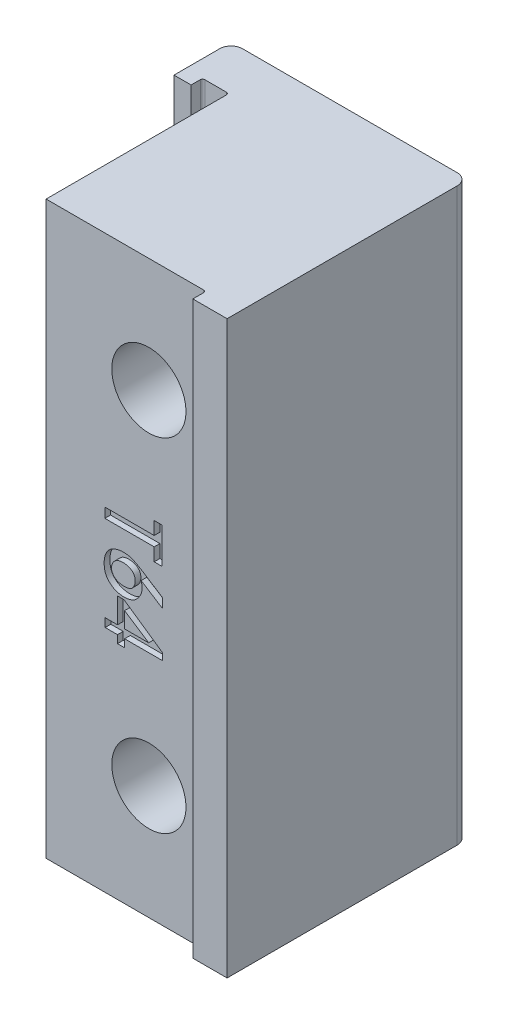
ISO-10303-21;
HEADER;
FILE_DESCRIPTION(('STEP AP214'),'2;1');
FILE_NAME('part.step','',(''),(''),'','','');
FILE_SCHEMA(('AUTOMOTIVE_DESIGN { 1 0 10303 214 1 1 1 1 }'));
ENDSEC;
DATA;
#1=APPLICATION_CONTEXT('core data for automotive mechanical design processes');
#2=APPLICATION_PROTOCOL_DEFINITION('international standard','automotive_design',2000,#1);
#3=PRODUCT_CONTEXT('',#1,'mechanical');
#4=PRODUCT('Part','Part','',(#3));
#5=PRODUCT_RELATED_PRODUCT_CATEGORY('part','',(#4));
#6=PRODUCT_DEFINITION_FORMATION('','',#4);
#7=PRODUCT_DEFINITION_CONTEXT('part definition',#1,'design');
#8=PRODUCT_DEFINITION('design','',#6,#7);
#9=PRODUCT_DEFINITION_SHAPE('','',#8);
#10=(LENGTH_UNIT() NAMED_UNIT(*) SI_UNIT(.MILLI.,.METRE.));
#11=(NAMED_UNIT(*) PLANE_ANGLE_UNIT() SI_UNIT($,.RADIAN.));
#12=(NAMED_UNIT(*) SI_UNIT($,.STERADIAN.) SOLID_ANGLE_UNIT());
#13=UNCERTAINTY_MEASURE_WITH_UNIT(LENGTH_MEASURE(1.E-05),#10,'distance_accuracy_value','');
#14=(GEOMETRIC_REPRESENTATION_CONTEXT(3) GLOBAL_UNCERTAINTY_ASSIGNED_CONTEXT((#13)) GLOBAL_UNIT_ASSIGNED_CONTEXT((#10,
#11,#12)) REPRESENTATION_CONTEXT('',''));
#15=CARTESIAN_POINT('',(0.,0.,0.));
#16=DIRECTION('',(0.,0.,1.));
#17=DIRECTION('',(1.,0.,0.));
#18=AXIS2_PLACEMENT_3D('',#15,#16,#17);
#19=CARTESIAN_POINT('',(-17.,50.,20.));
#20=DIRECTION('',(0.,0.,-1.));
#21=DIRECTION('',(-1.,0.,0.));
#22=AXIS2_PLACEMENT_3D('',#19,#20,#21);
#23=PLANE('',#22);
#24=CARTESIAN_POINT('',(-8.67739858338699,25.2318094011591,20.));
#25=CARTESIAN_POINT('',(-8.6620120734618,25.1776845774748,20.));
#26=CARTESIAN_POINT('',(-8.63202850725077,25.0722119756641,20.));
#27=CARTESIAN_POINT('',(-8.60607723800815,24.9134890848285,20.));
#28=CARTESIAN_POINT('',(-8.59219839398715,24.7602568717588,20.));
#29=CARTESIAN_POINT('',(-8.59432197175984,24.611724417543,20.));
#30=CARTESIAN_POINT('',(-8.61117301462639,24.4680710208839,20.));
#31=CARTESIAN_POINT('',(-8.64418856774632,24.3298361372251,20.));
#32=CARTESIAN_POINT('',(-8.68949651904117,24.1955769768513,20.));
#33=CARTESIAN_POINT('',(-8.75297258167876,24.0697436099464,20.));
#34=CARTESIAN_POINT('',(-8.82201643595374,23.9510065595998,20.));
#35=CARTESIAN_POINT('',(-8.89380655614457,23.8411943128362,20.));
#36=CARTESIAN_POINT('',(-8.96777358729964,23.7420469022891,20.));
#37=CARTESIAN_POINT('',(-9.04438252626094,23.6536718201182,20.));
#38=CARTESIAN_POINT('',(-9.12203112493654,23.5752106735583,20.));
#39=CARTESIAN_POINT('',(-9.20250701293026,23.5076865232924,20.));
#40=CARTESIAN_POINT('',(-9.28471691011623,23.4507214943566,20.));
#41=CARTESIAN_POINT('',(-9.39698237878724,23.389522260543,20.));
#42=CARTESIAN_POINT('',(-9.54233101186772,23.3302937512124,20.));
#43=CARTESIAN_POINT('',(-9.72238639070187,23.277926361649,20.));
#44=CARTESIAN_POINT('',(-9.90767747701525,23.2416969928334,20.));
#45=CARTESIAN_POINT('',(-10.0976351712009,23.2263049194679,20.));
#46=CARTESIAN_POINT('',(-10.2898643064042,23.2282953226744,20.));
#47=CARTESIAN_POINT('',(-10.4820323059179,23.2489618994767,20.));
#48=CARTESIAN_POINT('',(-10.6730943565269,23.2868949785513,20.));
#49=CARTESIAN_POINT('',(-10.8628845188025,23.3416827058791,20.));
#50=CARTESIAN_POINT('',(-11.048826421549,23.4215026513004,20.));
#51=CARTESIAN_POINT('',(-11.228870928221,23.5289388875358,20.));
#52=CARTESIAN_POINT('',(-11.4005377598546,23.6663026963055,20.));
#53=CARTESIAN_POINT('',(-11.5373705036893,23.7993807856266,20.));
#54=CARTESIAN_POINT('',(-11.6379941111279,23.9213032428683,20.));
#55=CARTESIAN_POINT('',(-11.7052376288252,24.0234742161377,20.));
#56=CARTESIAN_POINT('',(-11.7626353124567,24.134175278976,20.));
#57=CARTESIAN_POINT('',(-11.8127733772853,24.2530363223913,20.));
#58=CARTESIAN_POINT('',(-11.8521391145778,24.3811021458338,20.));
#59=CARTESIAN_POINT('',(-11.8816089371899,24.5176339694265,20.));
#60=CARTESIAN_POINT('',(-11.903536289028,24.6624042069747,20.));
#61=CARTESIAN_POINT('',(-11.9143613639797,24.8134355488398,20.));
#62=CARTESIAN_POINT('',(-11.9176751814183,24.965674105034,20.));
#63=CARTESIAN_POINT('',(-11.9128240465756,25.1144743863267,20.));
#64=CARTESIAN_POINT('',(-11.8975926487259,25.2571248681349,20.));
#65=CARTESIAN_POINT('',(-11.8743531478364,25.3934595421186,20.));
#66=CARTESIAN_POINT('',(-11.8419282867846,25.5232982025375,20.));
#67=CARTESIAN_POINT('',(-11.8009624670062,25.6470065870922,20.));
#68=CARTESIAN_POINT('',(-11.7523669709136,25.7653618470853,20.));
#69=CARTESIAN_POINT('',(-11.6924338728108,25.875939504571,20.));
#70=CARTESIAN_POINT('',(-11.6265248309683,25.9799567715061,20.));
#71=CARTESIAN_POINT('',(-11.5531980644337,26.0754409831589,20.));
#72=CARTESIAN_POINT('',(-11.4747097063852,26.1635061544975,20.));
#73=CARTESIAN_POINT('',(-11.3884846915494,26.2419027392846,20.));
#74=CARTESIAN_POINT('',(-11.2954843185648,26.3117693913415,20.));
#75=CARTESIAN_POINT('',(-11.1969865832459,26.3746352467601,20.));
#76=CARTESIAN_POINT('',(-11.0907546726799,26.4269536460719,20.));
#77=CARTESIAN_POINT('',(-10.9435377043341,26.4861065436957,20.));
#78=CARTESIAN_POINT('',(-10.7553495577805,26.5410321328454,20.));
#79=CARTESIAN_POINT('',(-10.5313227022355,26.5888994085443,20.));
#80=CARTESIAN_POINT('',(-10.3100914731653,26.6100300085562,20.));
#81=CARTESIAN_POINT('',(-10.1648608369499,26.6055613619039,20.));
#82=CARTESIAN_POINT('',(-10.092938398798,26.6033483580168,20.));
#83=B_SPLINE_CURVE_WITH_KNOTS('',3,(#24,#25,#26,#27,#28,#29,#30,#31,#32,#33,#34,#35,#36,#37,#38,
#39,#40,#41,#42,#43,#44,#45,#46,#47,#48,#49,#50,#51,#52,#53,#54,#55,#56,#57,#58,#59,#60,#61,#62,
#63,#64,#65,#66,#67,#68,#69,#70,#71,#72,#73,#74,#75,#76,#77,#78,#79,#80,#81,#82),.UNSPECIFIED.,
.F.,.F.,(4,1,1,1,1,1,1,1,1,1,1,1,1,1,1,1,1,1,1,1,1,1,1,1,1,1,1,1,1,1,1,1,1,1,1,1,1,1,1,1,1,1,1,
1,1,1,1,1,1,1,1,1,1,1,1,1,4),(0.,0.0197930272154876,0.0385705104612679,0.0565162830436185,
0.073896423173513,0.0907658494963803,0.107321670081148,0.123849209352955,0.140520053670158,
0.15682735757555,0.172195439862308,0.186677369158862,0.200336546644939,0.213337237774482,
0.225494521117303,0.237266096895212,0.248482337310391,0.270442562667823,0.292359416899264,
0.31441439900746,0.336783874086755,0.359326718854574,0.381994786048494,0.404715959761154,
0.427826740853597,0.451406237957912,0.475745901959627,0.501392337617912,0.528640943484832,
0.542782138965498,0.556962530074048,0.571607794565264,0.586622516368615,0.602315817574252,
0.618692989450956,0.635754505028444,0.653815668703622,0.671953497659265,0.689343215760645,
0.706184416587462,0.722415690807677,0.737992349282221,0.753244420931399,0.768259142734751,
0.782963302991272,0.797460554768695,0.811565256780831,0.825296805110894,0.838935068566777,
0.852510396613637,0.866206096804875,0.880003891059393,0.894128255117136,0.922015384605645,
0.948885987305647,0.974686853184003,1.),.UNSPECIFIED.);
#84=CARTESIAN_POINT('',(-8.67739858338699,25.2318094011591,20.));
#85=VERTEX_POINT('',#84);
#86=CARTESIAN_POINT('',(-10.092938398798,26.6033483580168,20.));
#87=VERTEX_POINT('',#86);
#88=EDGE_CURVE('E419',#85,#87,#83,.T.);
#89=ORIENTED_EDGE('',*,*,#88,.T.);
#90=CARTESIAN_POINT('',(-10.092938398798,26.6033483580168,20.));
#91=CARTESIAN_POINT('',(-10.0244865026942,26.597613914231,20.));
#92=CARTESIAN_POINT('',(-9.89230210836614,26.5865403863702,20.));
#93=CARTESIAN_POINT('',(-9.70374318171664,26.553438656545,20.));
#94=CARTESIAN_POINT('',(-9.53210965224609,26.5077313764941,20.));
#95=CARTESIAN_POINT('',(-9.37343212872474,26.4458189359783,20.));
#96=CARTESIAN_POINT('',(-9.21497735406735,26.3688161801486,20.));
#97=CARTESIAN_POINT('',(-9.04351592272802,26.2783720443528,20.));
#98=CARTESIAN_POINT('',(-8.85354202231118,26.1720165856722,20.));
#99=CARTESIAN_POINT('',(-8.72193490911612,26.0938914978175,20.));
#100=CARTESIAN_POINT('',(-8.65271517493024,26.052801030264,20.));
#101=B_SPLINE_CURVE_WITH_KNOTS('',3,(#90,#91,#92,#93,#94,#95,#96,#97,#98,#99,#100),
.UNSPECIFIED.,.F.,.F.,(4,1,1,1,1,1,1,1,4),(0.,0.131965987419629,0.254833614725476,
0.367414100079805,0.472751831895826,0.581618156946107,0.705861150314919,0.845295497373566,1.),.UNSPECIFIED.);
#102=CARTESIAN_POINT('',(-8.65271517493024,26.052801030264,20.));
#103=VERTEX_POINT('',#102);
#104=EDGE_CURVE('E481',#87,#103,#101,.T.);
#105=ORIENTED_EDGE('',*,*,#104,.T.);
#106=DIRECTION('',(0.84219163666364,-0.539178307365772,0.));
#107=VECTOR('',#106,1.);
#108=CARTESIAN_POINT('',(-8.65271517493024,26.052801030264,20.));
#109=LINE('',#108,#107);
#110=CARTESIAN_POINT('',(-6.80038634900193,24.866924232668,20.));
#111=VERTEX_POINT('',#110);
#112=EDGE_CURVE('E489',#103,#111,#109,.T.);
#113=ORIENTED_EDGE('',*,*,#112,.T.);
#114=DIRECTION('',(0.,-1.,0.));
#115=VECTOR('',#114,1.);
#116=CARTESIAN_POINT('',(-6.80038634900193,24.866924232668,20.));
#117=LINE('',#116,#115);
#118=CARTESIAN_POINT('',(-6.80038634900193,24.0373470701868,20.));
#119=VERTEX_POINT('',#118);
#120=EDGE_CURVE('E495',#111,#119,#117,.T.);
#121=ORIENTED_EDGE('',*,*,#120,.T.);
#122=DIRECTION('',(-0.843661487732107,0.536875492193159,0.));
#123=VECTOR('',#122,1.);
#124=CARTESIAN_POINT('',(-6.80038634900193,24.0373470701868,20.));
#125=LINE('',#124,#123);
#126=EDGE_CURVE('E498',#119,#85,#125,.T.);
#127=ORIENTED_EDGE('',*,*,#126,.T.);
#128=EDGE_LOOP('',(#89,#105,#113,#121,#127));
#129=FACE_BOUND('',#128,.T.);
#130=DIRECTION('',(1.,0.,0.));
#131=VECTOR('',#130,1.);
#132=CARTESIAN_POINT('',(-17.,0.,20.));
#133=LINE('',#132,#131);
#134=CARTESIAN_POINT('',(-17.,0.,20.));
#135=VERTEX_POINT('',#134);
#136=CARTESIAN_POINT('',(-3.2,0.,20.));
#137=VERTEX_POINT('',#136);
#138=EDGE_CURVE('E636',#135,#137,#133,.T.);
#139=ORIENTED_EDGE('',*,*,#138,.T.);
#140=DIRECTION('',(0.,-1.,0.));
#141=VECTOR('',#140,1.);
#142=CARTESIAN_POINT('',(-3.2,50.,20.));
#143=LINE('',#142,#141);
#144=CARTESIAN_POINT('',(-3.2,50.,20.));
#145=VERTEX_POINT('',#144);
#146=EDGE_CURVE('E681',#137,#145,#143,.F.);
#147=ORIENTED_EDGE('',*,*,#146,.T.);
#148=DIRECTION('',(1.,0.,0.));
#149=VECTOR('',#148,1.);
#150=CARTESIAN_POINT('',(-17.,50.,20.));
#151=LINE('',#150,#149);
#152=CARTESIAN_POINT('',(-17.,50.,20.));
#153=VERTEX_POINT('',#152);
#154=EDGE_CURVE('E610',#153,#145,#151,.T.);
#155=ORIENTED_EDGE('',*,*,#154,.F.);
#156=DIRECTION('',(0.,-1.,0.));
#157=VECTOR('',#156,1.);
#158=CARTESIAN_POINT('',(-17.,50.,20.));
#159=LINE('',#158,#157);
#160=EDGE_CURVE('E647',#153,#135,#159,.T.);
#161=ORIENTED_EDGE('',*,*,#160,.T.);
#162=EDGE_LOOP('',(#139,#147,#155,#161));
#163=FACE_BOUND('',#162,.T.);
#164=CARTESIAN_POINT('',(-8.,10.,20.));
#165=DIRECTION('',(0.,0.,-1.));
#166=DIRECTION('',(-1.,0.,0.));
#167=AXIS2_PLACEMENT_3D('',#164,#165,#166);
#168=CIRCLE('',#167,3.25);
#169=CARTESIAN_POINT('',(-11.25,10.,20.));
#170=VERTEX_POINT('',#169);
#171=EDGE_CURVE('E590',#170,#170,#168,.T.);
#172=ORIENTED_EDGE('',*,*,#171,.T.);
#173=EDGE_LOOP('',(#172));
#174=FACE_BOUND('',#173,.T.);
#175=CARTESIAN_POINT('',(-8.,40.,20.));
#176=DIRECTION('',(0.,0.,-1.));
#177=DIRECTION('',(-1.,0.,0.));
#178=AXIS2_PLACEMENT_3D('',#175,#176,#177);
#179=CIRCLE('',#178,3.25);
#180=CARTESIAN_POINT('',(-11.25,40.,20.));
#181=VERTEX_POINT('',#180);
#182=EDGE_CURVE('E580',#181,#181,#179,.T.);
#183=ORIENTED_EDGE('',*,*,#182,.T.);
#184=EDGE_LOOP('',(#183));
#185=FACE_BOUND('',#184,.T.);
#186=DIRECTION('',(-1.,0.,0.));
#187=VECTOR('',#186,1.);
#188=CARTESIAN_POINT('',(-6.85726550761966,27.2182871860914,20.));
#189=LINE('',#188,#187);
#190=CARTESIAN_POINT('',(-6.85726550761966,27.2182871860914,20.));
#191=VERTEX_POINT('',#190);
#192=CARTESIAN_POINT('',(-7.53444945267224,27.2182871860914,20.));
#193=VERTEX_POINT('',#192);
#194=EDGE_CURVE('E512',#191,#193,#189,.T.);
#195=ORIENTED_EDGE('',*,*,#194,.T.);
#196=DIRECTION('',(0.,1.,0.));
#197=VECTOR('',#196,1.);
#198=CARTESIAN_POINT('',(-7.53444945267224,27.2182871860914,20.));
#199=LINE('',#198,#197);
#200=CARTESIAN_POINT('',(-7.53444945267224,28.355870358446,20.));
#201=VERTEX_POINT('',#200);
#202=EDGE_CURVE('E534',#193,#201,#199,.T.);
#203=ORIENTED_EDGE('',*,*,#202,.T.);
#204=DIRECTION('',(-1.,0.,0.));
#205=VECTOR('',#204,1.);
#206=CARTESIAN_POINT('',(-7.53444945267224,28.355870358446,20.));
#207=LINE('',#206,#205);
#208=CARTESIAN_POINT('',(-11.8572655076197,28.355870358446,20.));
#209=VERTEX_POINT('',#208);
#210=EDGE_CURVE('E537',#201,#209,#207,.T.);
#211=ORIENTED_EDGE('',*,*,#210,.T.);
#212=DIRECTION('',(0.,1.,0.));
#213=VECTOR('',#212,1.);
#214=CARTESIAN_POINT('',(-11.8572655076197,28.355870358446,20.));
#215=LINE('',#214,#213);
#216=CARTESIAN_POINT('',(-11.8572655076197,29.2154968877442,20.));
#217=VERTEX_POINT('',#216);
#218=EDGE_CURVE('E540',#209,#217,#215,.T.);
#219=ORIENTED_EDGE('',*,*,#218,.T.);
#220=DIRECTION('',(1.,0.,0.));
#221=VECTOR('',#220,1.);
#222=CARTESIAN_POINT('',(-11.8572655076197,29.2154968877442,20.));
#223=LINE('',#222,#221);
#224=CARTESIAN_POINT('',(-7.53444945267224,29.2154968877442,20.));
#225=VERTEX_POINT('',#224);
#226=EDGE_CURVE('E543',#217,#225,#223,.T.);
#227=ORIENTED_EDGE('',*,*,#226,.T.);
#228=DIRECTION('',(0.,1.,0.));
#229=VECTOR('',#228,1.);
#230=CARTESIAN_POINT('',(-7.53444945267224,29.2154968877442,20.));
#231=LINE('',#230,#229);
#232=CARTESIAN_POINT('',(-7.53444945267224,30.3530800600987,20.));
#233=VERTEX_POINT('',#232);
#234=EDGE_CURVE('E546',#225,#233,#231,.T.);
#235=ORIENTED_EDGE('',*,*,#234,.T.);
#236=DIRECTION('',(1.,0.,0.));
#237=VECTOR('',#236,1.);
#238=CARTESIAN_POINT('',(-7.53444945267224,30.3530800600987,20.));
#239=LINE('',#238,#237);
#240=CARTESIAN_POINT('',(-6.85726550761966,30.3530800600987,20.));
#241=VERTEX_POINT('',#240);
#242=EDGE_CURVE('E549',#233,#241,#239,.T.);
#243=ORIENTED_EDGE('',*,*,#242,.T.);
#244=DIRECTION('',(0.,-1.,0.));
#245=VECTOR('',#244,1.);
#246=CARTESIAN_POINT('',(-6.85726550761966,30.3530800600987,20.));
#247=LINE('',#246,#245);
#248=EDGE_CURVE('E517',#241,#191,#247,.T.);
#249=ORIENTED_EDGE('',*,*,#248,.T.);
#250=EDGE_LOOP('',(#195,#203,#211,#219,#227,#235,#243,#249));
#251=FACE_BOUND('',#250,.T.);
#252=DIRECTION('',(1.,0.,0.));
#253=VECTOR('',#252,1.);
#254=CARTESIAN_POINT('',(-11.8293625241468,20.8360163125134,20.));
#255=LINE('',#254,#253);
#256=CARTESIAN_POINT('',(-11.8293625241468,20.8360163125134,20.));
#257=VERTEX_POINT('',#256);
#258=CARTESIAN_POINT('',(-10.74865851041,20.8360163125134,20.));
#259=VERTEX_POINT('',#258);
#260=EDGE_CURVE('E49',#257,#259,#255,.T.);
#261=ORIENTED_EDGE('',*,*,#260,.T.);
#262=DIRECTION('',(0.,1.,0.));
#263=VECTOR('',#262,1.);
#264=CARTESIAN_POINT('',(-10.74865851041,20.8360163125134,20.));
#265=LINE('',#264,#263);
#266=CARTESIAN_POINT('',(-10.74865851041,23.02532732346,20.));
#267=VERTEX_POINT('',#266);
#268=EDGE_CURVE('E362',#259,#267,#265,.T.);
#269=ORIENTED_EDGE('',*,*,#268,.T.);
#270=DIRECTION('',(1.,0.,0.));
#271=VECTOR('',#270,1.);
#272=CARTESIAN_POINT('',(-10.74865851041,23.02532732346,20.));
#273=LINE('',#272,#271);
#274=CARTESIAN_POINT('',(-10.1745009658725,23.02532732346,20.));
#275=VERTEX_POINT('',#274);
#276=EDGE_CURVE('E365',#267,#275,#273,.T.);
#277=ORIENTED_EDGE('',*,*,#276,.T.);
#278=DIRECTION('',(0.822267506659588,-0.569101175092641,0.));
#279=VECTOR('',#278,1.);
#280=CARTESIAN_POINT('',(-10.1745009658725,23.02532732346,20.));
#281=LINE('',#280,#279);
#282=CARTESIAN_POINT('',(-6.80038634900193,20.690062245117,20.));
#283=VERTEX_POINT('',#282);
#284=EDGE_CURVE('E368',#275,#283,#281,.T.);
#285=ORIENTED_EDGE('',*,*,#284,.T.);
#286=DIRECTION('',(0.,-1.,0.));
#287=VECTOR('',#286,1.);
#288=CARTESIAN_POINT('',(-6.80038634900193,20.690062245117,20.));
#289=LINE('',#288,#287);
#290=CARTESIAN_POINT('',(-6.80038634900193,20.0890749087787,20.));
#291=VERTEX_POINT('',#290);
#292=EDGE_CURVE('E371',#283,#291,#289,.T.);
#293=ORIENTED_EDGE('',*,*,#292,.T.);
#294=DIRECTION('',(-1.,0.,0.));
#295=VECTOR('',#294,1.);
#296=CARTESIAN_POINT('',(-6.80038634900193,20.0890749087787,20.));
#297=LINE('',#296,#295);
#298=CARTESIAN_POINT('',(-10.1272805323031,20.0890749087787,20.));
#299=VERTEX_POINT('',#298);
#300=EDGE_CURVE('E374',#291,#299,#297,.T.);
#301=ORIENTED_EDGE('',*,*,#300,.T.);
#302=DIRECTION('',(0.,-1.,0.));
#303=VECTOR('',#302,1.);
#304=CARTESIAN_POINT('',(-10.1272805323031,20.0890749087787,20.));
#305=LINE('',#304,#303);
#306=CARTESIAN_POINT('',(-10.1272805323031,19.406525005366,20.));
#307=VERTEX_POINT('',#306);
#308=EDGE_CURVE('E377',#299,#307,#305,.T.);
#309=ORIENTED_EDGE('',*,*,#308,.T.);
#310=DIRECTION('',(-1.,0.,0.));
#311=VECTOR('',#310,1.);
#312=CARTESIAN_POINT('',(-10.1272805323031,19.406525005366,20.));
#313=LINE('',#312,#311);
#314=CARTESIAN_POINT('',(-10.74865851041,19.406525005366,20.));
#315=VERTEX_POINT('',#314);
#316=EDGE_CURVE('E380',#307,#315,#313,.T.);
#317=ORIENTED_EDGE('',*,*,#316,.T.);
#318=DIRECTION('',(0.,1.,0.));
#319=VECTOR('',#318,1.);
#320=CARTESIAN_POINT('',(-10.74865851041,19.406525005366,20.));
#321=LINE('',#320,#319);
#322=CARTESIAN_POINT('',(-10.74865851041,20.0890749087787,20.));
#323=VERTEX_POINT('',#322);
#324=EDGE_CURVE('E383',#315,#323,#321,.T.);
#325=ORIENTED_EDGE('',*,*,#324,.T.);
#326=DIRECTION('',(-1.,0.,0.));
#327=VECTOR('',#326,1.);
#328=CARTESIAN_POINT('',(-10.74865851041,20.0890749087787,20.));
#329=LINE('',#328,#327);
#330=CARTESIAN_POINT('',(-11.8293625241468,20.0890749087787,20.));
#331=VERTEX_POINT('',#330);
#332=EDGE_CURVE('E386',#323,#331,#329,.T.);
#333=ORIENTED_EDGE('',*,*,#332,.T.);
#334=DIRECTION('',(0.,1.,0.));
#335=VECTOR('',#334,1.);
#336=CARTESIAN_POINT('',(-11.8293625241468,20.0890749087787,20.));
#337=LINE('',#336,#335);
#338=EDGE_CURVE('E340',#331,#257,#337,.T.);
#339=ORIENTED_EDGE('',*,*,#338,.T.);
#340=EDGE_LOOP('',(#261,#269,#277,#285,#293,#301,#309,#317,#325,#333,#339));
#341=FACE_BOUND('',#340,.T.);
#342=ADVANCED_FACE('F34',(#129,#163,#174,#185,#251,#341),#23,.F.);
#343=CARTESIAN_POINT('',(0.,50.,21.15));
#344=DIRECTION('',(-1.,0.,0.));
#345=DIRECTION('',(0.,0.,1.));
#346=AXIS2_PLACEMENT_3D('',#343,#344,#345);
#347=PLANE('',#346);
#348=DIRECTION('',(0.,0.,-1.));
#349=VECTOR('',#348,1.);
#350=CARTESIAN_POINT('',(0.,0.,21.15));
#351=LINE('',#350,#349);
#352=CARTESIAN_POINT('',(0.,0.,21.15));
#353=VERTEX_POINT('',#352);
#354=CARTESIAN_POINT('',(0.,0.,1.00000000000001));
#355=VERTEX_POINT('',#354);
#356=EDGE_CURVE('E618',#353,#355,#351,.T.);
#357=ORIENTED_EDGE('',*,*,#356,.T.);
#358=DIRECTION('',(0.,-1.,0.));
#359=VECTOR('',#358,1.);
#360=CARTESIAN_POINT('',(0.,50.,1.));
#361=LINE('',#360,#359);
#362=CARTESIAN_POINT('',(0.,50.,1.00000000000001));
#363=VERTEX_POINT('',#362);
#364=EDGE_CURVE('E692',#355,#363,#361,.F.);
#365=ORIENTED_EDGE('',*,*,#364,.T.);
#366=DIRECTION('',(0.,0.,-1.));
#367=VECTOR('',#366,1.);
#368=CARTESIAN_POINT('',(0.,50.,21.15));
#369=LINE('',#368,#367);
#370=CARTESIAN_POINT('',(0.,50.,21.15));
#371=VERTEX_POINT('',#370);
#372=EDGE_CURVE('E591',#371,#363,#369,.T.);
#373=ORIENTED_EDGE('',*,*,#372,.F.);
#374=DIRECTION('',(0.,-1.,0.));
#375=VECTOR('',#374,1.);
#376=CARTESIAN_POINT('',(0.,50.,21.15));
#377=LINE('',#376,#375);
#378=EDGE_CURVE('E617',#371,#353,#377,.T.);
#379=ORIENTED_EDGE('',*,*,#378,.T.);
#380=EDGE_LOOP('',(#357,#365,#373,#379));
#381=FACE_BOUND('',#380,.T.);
#382=ADVANCED_FACE('F768',(#381),#347,.F.);
#383=CARTESIAN_POINT('',(-20.8,50.,0.));
#384=DIRECTION('',(0.,0.,1.));
#385=DIRECTION('',(1.,0.,0.));
#386=AXIS2_PLACEMENT_3D('',#383,#384,#385);
#387=PLANE('',#386);
#388=CARTESIAN_POINT('',(-8.,40.,0.));
#389=DIRECTION('',(0.,0.,-1.));
#390=DIRECTION('',(-1.,0.,0.));
#391=AXIS2_PLACEMENT_3D('',#388,#389,#390);
#392=CIRCLE('',#391,5.5);
#393=CARTESIAN_POINT('',(-13.5,40.,0.));
#394=VERTEX_POINT('',#393);
#395=EDGE_CURVE('E571',#394,#394,#392,.T.);
#396=ORIENTED_EDGE('',*,*,#395,.F.);
#397=EDGE_LOOP('',(#396));
#398=FACE_BOUND('',#397,.T.);
#399=CARTESIAN_POINT('',(-8.,10.,0.));
#400=DIRECTION('',(0.,0.,-1.));
#401=DIRECTION('',(-1.,0.,0.));
#402=AXIS2_PLACEMENT_3D('',#399,#400,#401);
#403=CIRCLE('',#402,5.5);
#404=CARTESIAN_POINT('',(-13.5,10.,0.));
#405=VERTEX_POINT('',#404);
#406=EDGE_CURVE('E581',#405,#405,#403,.T.);
#407=ORIENTED_EDGE('',*,*,#406,.F.);
#408=EDGE_LOOP('',(#407));
#409=FACE_BOUND('',#408,.T.);
#410=DIRECTION('',(-1.,0.,0.));
#411=VECTOR('',#410,1.);
#412=CARTESIAN_POINT('',(-20.8,0.,0.));
#413=LINE('',#412,#411);
#414=CARTESIAN_POINT('',(-1.,0.,0.));
#415=VERTEX_POINT('',#414);
#416=CARTESIAN_POINT('',(-19.8,0.,0.));
#417=VERTEX_POINT('',#416);
#418=EDGE_CURVE('E621',#415,#417,#413,.T.);
#419=ORIENTED_EDGE('',*,*,#418,.T.);
#420=DIRECTION('',(0.,-1.,0.));
#421=VECTOR('',#420,1.);
#422=CARTESIAN_POINT('',(-19.8,50.,0.));
#423=LINE('',#422,#421);
#424=CARTESIAN_POINT('',(-19.8,50.,0.));
#425=VERTEX_POINT('',#424);
#426=EDGE_CURVE('E42',#417,#425,#423,.F.);
#427=ORIENTED_EDGE('',*,*,#426,.T.);
#428=DIRECTION('',(-1.,0.,0.));
#429=VECTOR('',#428,1.);
#430=CARTESIAN_POINT('',(-20.8,50.,0.));
#431=LINE('',#430,#429);
#432=CARTESIAN_POINT('',(-1.,50.,0.));
#433=VERTEX_POINT('',#432);
#434=EDGE_CURVE('E594',#433,#425,#431,.T.);
#435=ORIENTED_EDGE('',*,*,#434,.F.);
#436=DIRECTION('',(0.,-1.,0.));
#437=VECTOR('',#436,1.);
#438=CARTESIAN_POINT('',(-1.,50.,0.));
#439=LINE('',#438,#437);
#440=EDGE_CURVE('E687',#433,#415,#439,.T.);
#441=ORIENTED_EDGE('',*,*,#440,.T.);
#442=EDGE_LOOP('',(#419,#427,#435,#441));
#443=FACE_BOUND('',#442,.T.);
#444=ADVANCED_FACE('F703',(#398,#409,#443),#387,.F.);
#445=CARTESIAN_POINT('',(-20.8,50.,5.));
#446=DIRECTION('',(1.,0.,0.));
#447=DIRECTION('',(0.,0.,-1.));
#448=AXIS2_PLACEMENT_3D('',#445,#446,#447);
#449=PLANE('',#448);
#450=DIRECTION('',(0.,0.,1.));
#451=VECTOR('',#450,1.);
#452=CARTESIAN_POINT('',(-20.8,50.,5.));
#453=LINE('',#452,#451);
#454=CARTESIAN_POINT('',(-20.8,50.,1.));
#455=VERTEX_POINT('',#454);
#456=CARTESIAN_POINT('',(-20.8,50.,5.));
#457=VERTEX_POINT('',#456);
#458=EDGE_CURVE('E598',#455,#457,#453,.T.);
#459=ORIENTED_EDGE('',*,*,#458,.F.);
#460=DIRECTION('',(0.,-1.,0.));
#461=VECTOR('',#460,1.);
#462=CARTESIAN_POINT('',(-20.8,50.,1.));
#463=LINE('',#462,#461);
#464=CARTESIAN_POINT('',(-20.8,0.,1.));
#465=VERTEX_POINT('',#464);
#466=EDGE_CURVE('E696',#455,#465,#463,.T.);
#467=ORIENTED_EDGE('',*,*,#466,.T.);
#468=DIRECTION('',(0.,0.,1.));
#469=VECTOR('',#468,1.);
#470=CARTESIAN_POINT('',(-20.8,0.,5.));
#471=LINE('',#470,#469);
#472=CARTESIAN_POINT('',(-20.8,0.,5.));
#473=VERTEX_POINT('',#472);
#474=EDGE_CURVE('E624',#465,#473,#471,.T.);
#475=ORIENTED_EDGE('',*,*,#474,.T.);
#476=DIRECTION('',(0.,-1.,0.));
#477=VECTOR('',#476,1.);
#478=CARTESIAN_POINT('',(-20.8,50.,5.));
#479=LINE('',#478,#477);
#480=EDGE_CURVE('E653',#457,#473,#479,.T.);
#481=ORIENTED_EDGE('',*,*,#480,.F.);
#482=EDGE_LOOP('',(#459,#467,#475,#481));
#483=FACE_BOUND('',#482,.T.);
#484=ADVANCED_FACE('F715',(#483),#449,.F.);
#485=CARTESIAN_POINT('',(-20.8,50.,5.));
#486=DIRECTION('',(0.,0.,-1.));
#487=DIRECTION('',(-1.,0.,0.));
#488=AXIS2_PLACEMENT_3D('',#485,#486,#487);
#489=PLANE('',#488);
#490=DIRECTION('',(1.,0.,0.));
#491=VECTOR('',#490,1.);
#492=CARTESIAN_POINT('',(-20.8,0.,5.));
#493=LINE('',#492,#491);
#494=CARTESIAN_POINT('',(-19.3,0.,5.));
#495=VERTEX_POINT('',#494);
#496=EDGE_CURVE('E626',#473,#495,#493,.T.);
#497=ORIENTED_EDGE('',*,*,#496,.T.);
#498=DIRECTION('',(0.,-1.,0.));
#499=VECTOR('',#498,1.);
#500=CARTESIAN_POINT('',(-19.3,50.,5.));
#501=LINE('',#500,#499);
#502=CARTESIAN_POINT('',(-19.3,50.,5.));
#503=VERTEX_POINT('',#502);
#504=EDGE_CURVE('E650',#503,#495,#501,.T.);
#505=ORIENTED_EDGE('',*,*,#504,.F.);
#506=DIRECTION('',(1.,0.,0.));
#507=VECTOR('',#506,1.);
#508=CARTESIAN_POINT('',(-20.8,50.,5.));
#509=LINE('',#508,#507);
#510=EDGE_CURVE('E600',#457,#503,#509,.T.);
#511=ORIENTED_EDGE('',*,*,#510,.F.);
#512=ORIENTED_EDGE('',*,*,#480,.T.);
#513=EDGE_LOOP('',(#497,#505,#511,#512));
#514=FACE_BOUND('',#513,.T.);
#515=ADVANCED_FACE('F723',(#514),#489,.F.);
#516=CARTESIAN_POINT('',(-19.3,50.,5.));
#517=DIRECTION('',(-1.,0.,0.));
#518=DIRECTION('',(0.,0.,1.));
#519=AXIS2_PLACEMENT_3D('',#516,#517,#518);
#520=PLANE('',#519);
#521=DIRECTION('',(0.,0.,-1.));
#522=VECTOR('',#521,1.);
#523=CARTESIAN_POINT('',(-19.3,0.,5.));
#524=LINE('',#523,#522);
#525=CARTESIAN_POINT('',(-19.3,0.,4.2));
#526=VERTEX_POINT('',#525);
#527=EDGE_CURVE('E628',#495,#526,#524,.T.);
#528=ORIENTED_EDGE('',*,*,#527,.T.);
#529=DIRECTION('',(0.,-1.,0.));
#530=VECTOR('',#529,1.);
#531=CARTESIAN_POINT('',(-19.3,50.,4.2));
#532=LINE('',#531,#530);
#533=CARTESIAN_POINT('',(-19.3,50.,4.2));
#534=VERTEX_POINT('',#533);
#535=EDGE_CURVE('E663',#526,#534,#532,.F.);
#536=ORIENTED_EDGE('',*,*,#535,.T.);
#537=DIRECTION('',(0.,0.,-1.));
#538=VECTOR('',#537,1.);
#539=CARTESIAN_POINT('',(-19.3,50.,5.));
#540=LINE('',#539,#538);
#541=EDGE_CURVE('E602',#503,#534,#540,.T.);
#542=ORIENTED_EDGE('',*,*,#541,.F.);
#543=ORIENTED_EDGE('',*,*,#504,.T.);
#544=EDGE_LOOP('',(#528,#536,#542,#543));
#545=FACE_BOUND('',#544,.T.);
#546=ADVANCED_FACE('F727',(#545),#520,.F.);
#547=CARTESIAN_POINT('',(-19.3,50.,4.));
#548=DIRECTION('',(0.,0.,-1.));
#549=DIRECTION('',(-1.,0.,0.));
#550=AXIS2_PLACEMENT_3D('',#547,#548,#549);
#551=PLANE('',#550);
#552=DIRECTION('',(1.,0.,0.));
#553=VECTOR('',#552,1.);
#554=CARTESIAN_POINT('',(-19.3,0.,4.));
#555=LINE('',#554,#553);
#556=CARTESIAN_POINT('',(-19.1,0.,4.));
#557=VERTEX_POINT('',#556);
#558=CARTESIAN_POINT('',(-17.2,0.,4.));
#559=VERTEX_POINT('',#558);
#560=EDGE_CURVE('E631',#557,#559,#555,.T.);
#561=ORIENTED_EDGE('',*,*,#560,.T.);
#562=DIRECTION('',(0.,-1.,0.));
#563=VECTOR('',#562,1.);
#564=CARTESIAN_POINT('',(-17.2,50.,4.));
#565=LINE('',#564,#563);
#566=CARTESIAN_POINT('',(-17.2,50.,4.));
#567=VERTEX_POINT('',#566);
#568=EDGE_CURVE('E672',#559,#567,#565,.F.);
#569=ORIENTED_EDGE('',*,*,#568,.T.);
#570=DIRECTION('',(1.,0.,0.));
#571=VECTOR('',#570,1.);
#572=CARTESIAN_POINT('',(-19.3,50.,4.));
#573=LINE('',#572,#571);
#574=CARTESIAN_POINT('',(-19.1,50.,4.));
#575=VERTEX_POINT('',#574);
#576=EDGE_CURVE('E605',#575,#567,#573,.T.);
#577=ORIENTED_EDGE('',*,*,#576,.F.);
#578=DIRECTION('',(0.,-1.,0.));
#579=VECTOR('',#578,1.);
#580=CARTESIAN_POINT('',(-19.1,0.,4.));
#581=LINE('',#580,#579);
#582=EDGE_CURVE('E656',#575,#557,#581,.T.);
#583=ORIENTED_EDGE('',*,*,#582,.T.);
#584=EDGE_LOOP('',(#561,#569,#577,#583));
#585=FACE_BOUND('',#584,.T.);
#586=ADVANCED_FACE('F736',(#585),#551,.F.);
#587=CARTESIAN_POINT('',(-17.,50.,4.));
#588=DIRECTION('',(1.,0.,0.));
#589=DIRECTION('',(0.,0.,-1.));
#590=AXIS2_PLACEMENT_3D('',#587,#588,#589);
#591=PLANE('',#590);
#592=DIRECTION('',(0.,0.,1.));
#593=VECTOR('',#592,1.);
#594=CARTESIAN_POINT('',(-17.,50.,4.));
#595=LINE('',#594,#593);
#596=CARTESIAN_POINT('',(-17.,50.,4.2));
#597=VERTEX_POINT('',#596);
#598=EDGE_CURVE('E608',#597,#153,#595,.T.);
#599=ORIENTED_EDGE('',*,*,#598,.F.);
#600=DIRECTION('',(0.,-1.,0.));
#601=VECTOR('',#600,1.);
#602=CARTESIAN_POINT('',(-17.,0.,4.2));
#603=LINE('',#602,#601);
#604=CARTESIAN_POINT('',(-17.,0.,4.2));
#605=VERTEX_POINT('',#604);
#606=EDGE_CURVE('E669',#597,#605,#603,.T.);
#607=ORIENTED_EDGE('',*,*,#606,.T.);
#608=DIRECTION('',(0.,0.,1.));
#609=VECTOR('',#608,1.);
#610=CARTESIAN_POINT('',(-17.,0.,4.));
#611=LINE('',#610,#609);
#612=EDGE_CURVE('E634',#605,#135,#611,.T.);
#613=ORIENTED_EDGE('',*,*,#612,.T.);
#614=ORIENTED_EDGE('',*,*,#160,.F.);
#615=EDGE_LOOP('',(#599,#607,#613,#614));
#616=FACE_BOUND('',#615,.T.);
#617=ADVANCED_FACE('F746',(#616),#591,.F.);
#618=CARTESIAN_POINT('',(-3.,50.,20.));
#619=DIRECTION('',(1.,0.,0.));
#620=DIRECTION('',(0.,0.,-1.));
#621=AXIS2_PLACEMENT_3D('',#618,#619,#620);
#622=PLANE('',#621);
#623=DIRECTION('',(0.,0.,1.));
#624=VECTOR('',#623,1.);
#625=CARTESIAN_POINT('',(-3.,50.,20.));
#626=LINE('',#625,#624);
#627=CARTESIAN_POINT('',(-3.,50.,20.2));
#628=VERTEX_POINT('',#627);
#629=CARTESIAN_POINT('',(-3.,50.,21.15));
#630=VERTEX_POINT('',#629);
#631=EDGE_CURVE('E613',#628,#630,#626,.T.);
#632=ORIENTED_EDGE('',*,*,#631,.F.);
#633=DIRECTION('',(0.,-1.,0.));
#634=VECTOR('',#633,1.);
#635=CARTESIAN_POINT('',(-3.,0.,20.2));
#636=LINE('',#635,#634);
#637=CARTESIAN_POINT('',(-3.,0.,20.2));
#638=VERTEX_POINT('',#637);
#639=EDGE_CURVE('E678',#628,#638,#636,.T.);
#640=ORIENTED_EDGE('',*,*,#639,.T.);
#641=DIRECTION('',(0.,0.,1.));
#642=VECTOR('',#641,1.);
#643=CARTESIAN_POINT('',(-3.,0.,20.));
#644=LINE('',#643,#642);
#645=CARTESIAN_POINT('',(-3.,0.,21.15));
#646=VERTEX_POINT('',#645);
#647=EDGE_CURVE('E639',#638,#646,#644,.T.);
#648=ORIENTED_EDGE('',*,*,#647,.T.);
#649=DIRECTION('',(0.,-1.,0.));
#650=VECTOR('',#649,1.);
#651=CARTESIAN_POINT('',(-3.,50.,21.15));
#652=LINE('',#651,#650);
#653=EDGE_CURVE('E644',#630,#646,#652,.T.);
#654=ORIENTED_EDGE('',*,*,#653,.F.);
#655=EDGE_LOOP('',(#632,#640,#648,#654));
#656=FACE_BOUND('',#655,.T.);
#657=ADVANCED_FACE('F758',(#656),#622,.F.);
#658=CARTESIAN_POINT('',(-3.,50.,21.15));
#659=DIRECTION('',(0.,0.,-1.));
#660=DIRECTION('',(-1.,0.,0.));
#661=AXIS2_PLACEMENT_3D('',#658,#659,#660);
#662=PLANE('',#661);
#663=DIRECTION('',(1.,0.,0.));
#664=VECTOR('',#663,1.);
#665=CARTESIAN_POINT('',(-3.,0.,21.15));
#666=LINE('',#665,#664);
#667=EDGE_CURVE('E595',#646,#353,#666,.T.);
#668=ORIENTED_EDGE('',*,*,#667,.T.);
#669=ORIENTED_EDGE('',*,*,#378,.F.);
#670=DIRECTION('',(1.,0.,0.));
#671=VECTOR('',#670,1.);
#672=CARTESIAN_POINT('',(-3.,50.,21.15));
#673=LINE('',#672,#671);
#674=EDGE_CURVE('E615',#630,#371,#673,.T.);
#675=ORIENTED_EDGE('',*,*,#674,.F.);
#676=ORIENTED_EDGE('',*,*,#653,.T.);
#677=EDGE_LOOP('',(#668,#669,#675,#676));
#678=FACE_BOUND('',#677,.T.);
#679=ADVANCED_FACE('F764',(#678),#662,.F.);
#680=CARTESIAN_POINT('',(0.,50.,0.));
#681=DIRECTION('',(0.,-1.,0.));
#682=DIRECTION('',(0.,0.,-1.));
#683=AXIS2_PLACEMENT_3D('',#680,#681,#682);
#684=PLANE('',#683);
#685=ORIENTED_EDGE('',*,*,#434,.T.);
#686=CARTESIAN_POINT('',(-19.8,50.,1.));
#687=DIRECTION('',(0.,-1.,0.));
#688=DIRECTION('',(0.,0.,-1.));
#689=AXIS2_PLACEMENT_3D('',#686,#687,#688);
#690=CIRCLE('',#689,1.);
#691=EDGE_CURVE('E11',#425,#455,#690,.F.);
#692=ORIENTED_EDGE('',*,*,#691,.T.);
#693=ORIENTED_EDGE('',*,*,#458,.T.);
#694=ORIENTED_EDGE('',*,*,#510,.T.);
#695=ORIENTED_EDGE('',*,*,#541,.T.);
#696=CARTESIAN_POINT('',(-19.1,50.,4.2));
#697=DIRECTION('',(0.,-1.,0.));
#698=DIRECTION('',(0.,0.,-1.));
#699=AXIS2_PLACEMENT_3D('',#696,#697,#698);
#700=CIRCLE('',#699,0.2);
#701=EDGE_CURVE('E667',#534,#575,#700,.T.);
#702=ORIENTED_EDGE('',*,*,#701,.T.);
#703=ORIENTED_EDGE('',*,*,#576,.T.);
#704=CARTESIAN_POINT('',(-17.2,50.,4.2));
#705=DIRECTION('',(0.,-1.,0.));
#706=DIRECTION('',(0.,0.,-1.));
#707=AXIS2_PLACEMENT_3D('',#704,#705,#706);
#708=CIRCLE('',#707,0.2);
#709=EDGE_CURVE('E676',#567,#597,#708,.T.);
#710=ORIENTED_EDGE('',*,*,#709,.T.);
#711=ORIENTED_EDGE('',*,*,#598,.T.);
#712=ORIENTED_EDGE('',*,*,#154,.T.);
#713=CARTESIAN_POINT('',(-3.2,50.,20.2));
#714=DIRECTION('',(0.,-1.,0.));
#715=DIRECTION('',(0.,0.,-1.));
#716=AXIS2_PLACEMENT_3D('',#713,#714,#715);
#717=CIRCLE('',#716,0.2);
#718=EDGE_CURVE('E685',#145,#628,#717,.T.);
#719=ORIENTED_EDGE('',*,*,#718,.T.);
#720=ORIENTED_EDGE('',*,*,#631,.T.);
#721=ORIENTED_EDGE('',*,*,#674,.T.);
#722=ORIENTED_EDGE('',*,*,#372,.T.);
#723=CARTESIAN_POINT('',(-1.,50.,1.));
#724=DIRECTION('',(0.,-1.,0.));
#725=DIRECTION('',(0.,0.,-1.));
#726=AXIS2_PLACEMENT_3D('',#723,#724,#725);
#727=CIRCLE('',#726,1.);
#728=EDGE_CURVE('E694',#363,#433,#727,.F.);
#729=ORIENTED_EDGE('',*,*,#728,.T.);
#730=EDGE_LOOP('',(#685,#692,#693,#694,#695,#702,#703,#710,#711,#712,#719,#720,#721,#722,#729));
#731=FACE_BOUND('',#730,.T.);
#732=ADVANCED_FACE('F709',(#731),#684,.F.);
#733=CARTESIAN_POINT('',(0.,0.,0.));
#734=DIRECTION('',(0.,-1.,0.));
#735=DIRECTION('',(0.,0.,-1.));
#736=AXIS2_PLACEMENT_3D('',#733,#734,#735);
#737=PLANE('',#736);
#738=ORIENTED_EDGE('',*,*,#474,.F.);
#739=CARTESIAN_POINT('',(-19.8,0.,1.));
#740=DIRECTION('',(0.,-1.,0.));
#741=DIRECTION('',(0.,0.,-1.));
#742=AXIS2_PLACEMENT_3D('',#739,#740,#741);
#743=CIRCLE('',#742,1.);
#744=EDGE_CURVE('E699',#465,#417,#743,.T.);
#745=ORIENTED_EDGE('',*,*,#744,.T.);
#746=ORIENTED_EDGE('',*,*,#418,.F.);
#747=CARTESIAN_POINT('',(-1.,0.,1.));
#748=DIRECTION('',(0.,-1.,0.));
#749=DIRECTION('',(0.,0.,-1.));
#750=AXIS2_PLACEMENT_3D('',#747,#748,#749);
#751=CIRCLE('',#750,1.);
#752=EDGE_CURVE('E690',#415,#355,#751,.T.);
#753=ORIENTED_EDGE('',*,*,#752,.T.);
#754=ORIENTED_EDGE('',*,*,#356,.F.);
#755=ORIENTED_EDGE('',*,*,#667,.F.);
#756=ORIENTED_EDGE('',*,*,#647,.F.);
#757=CARTESIAN_POINT('',(-3.2,0.,20.2));
#758=DIRECTION('',(0.,-1.,0.));
#759=DIRECTION('',(0.,0.,-1.));
#760=AXIS2_PLACEMENT_3D('',#757,#758,#759);
#761=CIRCLE('',#760,0.2);
#762=EDGE_CURVE('E683',#638,#137,#761,.F.);
#763=ORIENTED_EDGE('',*,*,#762,.T.);
#764=ORIENTED_EDGE('',*,*,#138,.F.);
#765=ORIENTED_EDGE('',*,*,#612,.F.);
#766=CARTESIAN_POINT('',(-17.2,0.,4.2));
#767=DIRECTION('',(0.,-1.,0.));
#768=DIRECTION('',(0.,0.,-1.));
#769=AXIS2_PLACEMENT_3D('',#766,#767,#768);
#770=CIRCLE('',#769,0.2);
#771=EDGE_CURVE('E674',#605,#559,#770,.F.);
#772=ORIENTED_EDGE('',*,*,#771,.T.);
#773=ORIENTED_EDGE('',*,*,#560,.F.);
#774=CARTESIAN_POINT('',(-19.1,0.,4.2));
#775=DIRECTION('',(0.,-1.,0.));
#776=DIRECTION('',(0.,0.,-1.));
#777=AXIS2_PLACEMENT_3D('',#774,#775,#776);
#778=CIRCLE('',#777,0.2);
#779=EDGE_CURVE('E665',#557,#526,#778,.F.);
#780=ORIENTED_EDGE('',*,*,#779,.T.);
#781=ORIENTED_EDGE('',*,*,#527,.F.);
#782=ORIENTED_EDGE('',*,*,#496,.F.);
#783=EDGE_LOOP('',(#738,#745,#746,#753,#754,#755,#756,#763,#764,#765,#772,#773,#780,#781,#782));
#784=FACE_BOUND('',#783,.T.);
#785=ADVANCED_FACE('F719',(#784),#737,.T.);
#786=CARTESIAN_POINT('',(-8.,10.,0.));
#787=DIRECTION('',(0.,0.,-1.));
#788=DIRECTION('',(-1.,0.,0.));
#789=AXIS2_PLACEMENT_3D('',#786,#787,#788);
#790=CYLINDRICAL_SURFACE('',#789,3.25);
#791=CARTESIAN_POINT('',(-8.,10.,6.5));
#792=DIRECTION('',(0.,0.,-1.));
#793=DIRECTION('',(-1.,0.,0.));
#794=AXIS2_PLACEMENT_3D('',#791,#792,#793);
#795=CIRCLE('',#794,3.25);
#796=CARTESIAN_POINT('',(-11.25,10.,6.5));
#797=VERTEX_POINT('',#796);
#798=EDGE_CURVE('E587',#797,#797,#795,.T.);
#799=ORIENTED_EDGE('',*,*,#798,.T.);
#800=EDGE_LOOP('',(#799));
#801=FACE_BOUND('',#800,.T.);
#802=ORIENTED_EDGE('',*,*,#171,.F.);
#803=EDGE_LOOP('',(#802));
#804=FACE_BOUND('',#803,.T.);
#805=ADVANCED_FACE('F1122',(#801,#804),#790,.F.);
#806=CARTESIAN_POINT('',(-4.75,10.,6.5));
#807=DIRECTION('',(0.,0.,1.));
#808=DIRECTION('',(1.,0.,0.));
#809=AXIS2_PLACEMENT_3D('',#806,#807,#808);
#810=PLANE('',#809);
#811=ORIENTED_EDGE('',*,*,#798,.F.);
#812=EDGE_LOOP('',(#811));
#813=FACE_BOUND('',#812,.T.);
#814=CARTESIAN_POINT('',(-8.,10.,6.5));
#815=DIRECTION('',(0.,0.,-1.));
#816=DIRECTION('',(-1.,0.,0.));
#817=AXIS2_PLACEMENT_3D('',#814,#815,#816);
#818=CIRCLE('',#817,5.5);
#819=CARTESIAN_POINT('',(-13.5,10.,6.5));
#820=VERTEX_POINT('',#819);
#821=EDGE_CURVE('E584',#820,#820,#818,.T.);
#822=ORIENTED_EDGE('',*,*,#821,.T.);
#823=EDGE_LOOP('',(#822));
#824=FACE_BOUND('',#823,.T.);
#825=ADVANCED_FACE('F1254',(#813,#824),#810,.F.);
#826=CARTESIAN_POINT('',(-8.,10.,0.));
#827=DIRECTION('',(0.,0.,-1.));
#828=DIRECTION('',(-1.,0.,0.));
#829=AXIS2_PLACEMENT_3D('',#826,#827,#828);
#830=CYLINDRICAL_SURFACE('',#829,5.5);
#831=ORIENTED_EDGE('',*,*,#821,.F.);
#832=EDGE_LOOP('',(#831));
#833=FACE_BOUND('',#832,.T.);
#834=ORIENTED_EDGE('',*,*,#406,.T.);
#835=EDGE_LOOP('',(#834));
#836=FACE_BOUND('',#835,.T.);
#837=ADVANCED_FACE('F1244',(#833,#836),#830,.F.);
#838=CARTESIAN_POINT('',(-8.,40.,0.));
#839=DIRECTION('',(0.,0.,-1.));
#840=DIRECTION('',(-1.,0.,0.));
#841=AXIS2_PLACEMENT_3D('',#838,#839,#840);
#842=CYLINDRICAL_SURFACE('',#841,3.25);
#843=CARTESIAN_POINT('',(-8.,40.,6.5));
#844=DIRECTION('',(0.,0.,-1.));
#845=DIRECTION('',(-1.,0.,0.));
#846=AXIS2_PLACEMENT_3D('',#843,#844,#845);
#847=CIRCLE('',#846,3.25);
#848=CARTESIAN_POINT('',(-11.25,40.,6.5));
#849=VERTEX_POINT('',#848);
#850=EDGE_CURVE('E577',#849,#849,#847,.T.);
#851=ORIENTED_EDGE('',*,*,#850,.T.);
#852=EDGE_LOOP('',(#851));
#853=FACE_BOUND('',#852,.T.);
#854=ORIENTED_EDGE('',*,*,#182,.F.);
#855=EDGE_LOOP('',(#854));
#856=FACE_BOUND('',#855,.T.);
#857=ADVANCED_FACE('F1234',(#853,#856),#842,.F.);
#858=CARTESIAN_POINT('',(-4.75,40.,6.5));
#859=DIRECTION('',(0.,0.,1.));
#860=DIRECTION('',(1.,0.,0.));
#861=AXIS2_PLACEMENT_3D('',#858,#859,#860);
#862=PLANE('',#861);
#863=ORIENTED_EDGE('',*,*,#850,.F.);
#864=EDGE_LOOP('',(#863));
#865=FACE_BOUND('',#864,.T.);
#866=CARTESIAN_POINT('',(-8.,40.,6.5));
#867=DIRECTION('',(0.,0.,-1.));
#868=DIRECTION('',(-1.,0.,0.));
#869=AXIS2_PLACEMENT_3D('',#866,#867,#868);
#870=CIRCLE('',#869,5.5);
#871=CARTESIAN_POINT('',(-13.5,40.,6.5));
#872=VERTEX_POINT('',#871);
#873=EDGE_CURVE('E574',#872,#872,#870,.T.);
#874=ORIENTED_EDGE('',*,*,#873,.T.);
#875=EDGE_LOOP('',(#874));
#876=FACE_BOUND('',#875,.T.);
#877=ADVANCED_FACE('F1224',(#865,#876),#862,.F.);
#878=CARTESIAN_POINT('',(-8.,40.,0.));
#879=DIRECTION('',(0.,0.,-1.));
#880=DIRECTION('',(-1.,0.,0.));
#881=AXIS2_PLACEMENT_3D('',#878,#879,#880);
#882=CYLINDRICAL_SURFACE('',#881,5.5);
#883=ORIENTED_EDGE('',*,*,#873,.F.);
#884=EDGE_LOOP('',(#883));
#885=FACE_BOUND('',#884,.T.);
#886=ORIENTED_EDGE('',*,*,#395,.T.);
#887=EDGE_LOOP('',(#886));
#888=FACE_BOUND('',#887,.T.);
#889=ADVANCED_FACE('F1209',(#885,#888),#882,.F.);
#890=CARTESIAN_POINT('',(-19.1,50.,4.2));
#891=DIRECTION('',(0.,1.,0.));
#892=DIRECTION('',(0.,0.,1.));
#893=AXIS2_PLACEMENT_3D('',#890,#891,#892);
#894=CYLINDRICAL_SURFACE('',#893,0.2);
#895=ORIENTED_EDGE('',*,*,#701,.F.);
#896=ORIENTED_EDGE('',*,*,#535,.F.);
#897=ORIENTED_EDGE('',*,*,#779,.F.);
#898=ORIENTED_EDGE('',*,*,#582,.F.);
#899=EDGE_LOOP('',(#895,#896,#897,#898));
#900=FACE_BOUND('',#899,.T.);
#901=ADVANCED_FACE('F733',(#900),#894,.F.);
#902=CARTESIAN_POINT('',(-17.2,50.,4.2));
#903=DIRECTION('',(0.,1.,0.));
#904=DIRECTION('',(0.,0.,1.));
#905=AXIS2_PLACEMENT_3D('',#902,#903,#904);
#906=CYLINDRICAL_SURFACE('',#905,0.2);
#907=ORIENTED_EDGE('',*,*,#709,.F.);
#908=ORIENTED_EDGE('',*,*,#568,.F.);
#909=ORIENTED_EDGE('',*,*,#771,.F.);
#910=ORIENTED_EDGE('',*,*,#606,.F.);
#911=EDGE_LOOP('',(#907,#908,#909,#910));
#912=FACE_BOUND('',#911,.T.);
#913=ADVANCED_FACE('F743',(#912),#906,.F.);
#914=CARTESIAN_POINT('',(-3.2,50.,20.2));
#915=DIRECTION('',(0.,1.,0.));
#916=DIRECTION('',(0.,0.,1.));
#917=AXIS2_PLACEMENT_3D('',#914,#915,#916);
#918=CYLINDRICAL_SURFACE('',#917,0.2);
#919=ORIENTED_EDGE('',*,*,#718,.F.);
#920=ORIENTED_EDGE('',*,*,#146,.F.);
#921=ORIENTED_EDGE('',*,*,#762,.F.);
#922=ORIENTED_EDGE('',*,*,#639,.F.);
#923=EDGE_LOOP('',(#919,#920,#921,#922));
#924=FACE_BOUND('',#923,.T.);
#925=ADVANCED_FACE('F755',(#924),#918,.F.);
#926=CARTESIAN_POINT('',(-1.,50.,1.));
#927=DIRECTION('',(0.,-1.,0.));
#928=DIRECTION('',(0.,0.,-1.));
#929=AXIS2_PLACEMENT_3D('',#926,#927,#928);
#930=CYLINDRICAL_SURFACE('',#929,1.);
#931=ORIENTED_EDGE('',*,*,#728,.F.);
#932=ORIENTED_EDGE('',*,*,#364,.F.);
#933=ORIENTED_EDGE('',*,*,#752,.F.);
#934=ORIENTED_EDGE('',*,*,#440,.F.);
#935=EDGE_LOOP('',(#931,#932,#933,#934));
#936=FACE_BOUND('',#935,.T.);
#937=ADVANCED_FACE('F771',(#936),#930,.T.);
#938=CARTESIAN_POINT('',(-19.8,50.,1.));
#939=DIRECTION('',(0.,-1.,0.));
#940=DIRECTION('',(0.,0.,-1.));
#941=AXIS2_PLACEMENT_3D('',#938,#939,#940);
#942=CYLINDRICAL_SURFACE('',#941,1.);
#943=ORIENTED_EDGE('',*,*,#691,.F.);
#944=ORIENTED_EDGE('',*,*,#426,.F.);
#945=ORIENTED_EDGE('',*,*,#744,.F.);
#946=ORIENTED_EDGE('',*,*,#466,.F.);
#947=EDGE_LOOP('',(#943,#944,#945,#946));
#948=FACE_BOUND('',#947,.T.);
#949=ADVANCED_FACE('F36',(#948),#942,.T.);
#950=CARTESIAN_POINT('',(-6.85726550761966,27.2182871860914,19.5));
#951=DIRECTION('',(0.,1.,0.));
#952=DIRECTION('',(0.,0.,1.));
#953=AXIS2_PLACEMENT_3D('',#950,#951,#952);
#954=PLANE('',#953);
#955=ORIENTED_EDGE('',*,*,#194,.F.);
#956=DIRECTION('',(0.,0.,1.));
#957=VECTOR('',#956,1.);
#958=CARTESIAN_POINT('',(-6.85726550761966,27.2182871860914,19.5));
#959=LINE('',#958,#957);
#960=CARTESIAN_POINT('',(-6.85726550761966,27.2182871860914,19.5));
#961=VERTEX_POINT('',#960);
#962=EDGE_CURVE('E531',#961,#191,#959,.T.);
#963=ORIENTED_EDGE('',*,*,#962,.F.);
#964=DIRECTION('',(-1.,0.,0.));
#965=VECTOR('',#964,1.);
#966=CARTESIAN_POINT('',(-6.85726550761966,27.2182871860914,19.5));
#967=LINE('',#966,#965);
#968=CARTESIAN_POINT('',(-7.53444945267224,27.2182871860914,19.5));
#969=VERTEX_POINT('',#968);
#970=EDGE_CURVE('E513',#961,#969,#967,.T.);
#971=ORIENTED_EDGE('',*,*,#970,.T.);
#972=DIRECTION('',(0.,0.,1.));
#973=VECTOR('',#972,1.);
#974=CARTESIAN_POINT('',(-7.53444945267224,27.2182871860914,19.5));
#975=LINE('',#974,#973);
#976=EDGE_CURVE('E568',#969,#193,#975,.T.);
#977=ORIENTED_EDGE('',*,*,#976,.T.);
#978=EDGE_LOOP('',(#955,#963,#971,#977));
#979=FACE_BOUND('',#978,.T.);
#980=ADVANCED_FACE('F777',(#979),#954,.T.);
#981=CARTESIAN_POINT('',(-7.53444945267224,27.2182871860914,19.5));
#982=DIRECTION('',(1.,0.,0.));
#983=DIRECTION('',(0.,0.,-1.));
#984=AXIS2_PLACEMENT_3D('',#981,#982,#983);
#985=PLANE('',#984);
#986=ORIENTED_EDGE('',*,*,#202,.F.);
#987=ORIENTED_EDGE('',*,*,#976,.F.);
#988=DIRECTION('',(0.,1.,0.));
#989=VECTOR('',#988,1.);
#990=CARTESIAN_POINT('',(-7.53444945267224,27.2182871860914,19.5));
#991=LINE('',#990,#989);
#992=CARTESIAN_POINT('',(-7.53444945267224,28.355870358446,19.5));
#993=VERTEX_POINT('',#992);
#994=EDGE_CURVE('E516',#969,#993,#991,.T.);
#995=ORIENTED_EDGE('',*,*,#994,.T.);
#996=DIRECTION('',(0.,0.,1.));
#997=VECTOR('',#996,1.);
#998=CARTESIAN_POINT('',(-7.53444945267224,28.355870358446,19.5));
#999=LINE('',#998,#997);
#1000=EDGE_CURVE('E566',#993,#201,#999,.T.);
#1001=ORIENTED_EDGE('',*,*,#1000,.T.);
#1002=EDGE_LOOP('',(#986,#987,#995,#1001));
#1003=FACE_BOUND('',#1002,.T.);
#1004=ADVANCED_FACE('F882',(#1003),#985,.T.);
#1005=CARTESIAN_POINT('',(-7.53444945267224,28.355870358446,19.5));
#1006=DIRECTION('',(0.,1.,0.));
#1007=DIRECTION('',(0.,0.,1.));
#1008=AXIS2_PLACEMENT_3D('',#1005,#1006,#1007);
#1009=PLANE('',#1008);
#1010=ORIENTED_EDGE('',*,*,#210,.F.);
#1011=ORIENTED_EDGE('',*,*,#1000,.F.);
#1012=DIRECTION('',(-1.,0.,0.));
#1013=VECTOR('',#1012,1.);
#1014=CARTESIAN_POINT('',(-7.53444945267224,28.355870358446,19.5));
#1015=LINE('',#1014,#1013);
#1016=CARTESIAN_POINT('',(-11.8572655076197,28.355870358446,19.5));
#1017=VERTEX_POINT('',#1016);
#1018=EDGE_CURVE('E519',#993,#1017,#1015,.T.);
#1019=ORIENTED_EDGE('',*,*,#1018,.T.);
#1020=DIRECTION('',(0.,0.,1.));
#1021=VECTOR('',#1020,1.);
#1022=CARTESIAN_POINT('',(-11.8572655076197,28.355870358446,19.5));
#1023=LINE('',#1022,#1021);
#1024=EDGE_CURVE('E564',#1017,#209,#1023,.T.);
#1025=ORIENTED_EDGE('',*,*,#1024,.T.);
#1026=EDGE_LOOP('',(#1010,#1011,#1019,#1025));
#1027=FACE_BOUND('',#1026,.T.);
#1028=ADVANCED_FACE('F891',(#1027),#1009,.T.);
#1029=CARTESIAN_POINT('',(-11.8572655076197,28.355870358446,19.5));
#1030=DIRECTION('',(1.,0.,0.));
#1031=DIRECTION('',(0.,0.,-1.));
#1032=AXIS2_PLACEMENT_3D('',#1029,#1030,#1031);
#1033=PLANE('',#1032);
#1034=ORIENTED_EDGE('',*,*,#218,.F.);
#1035=ORIENTED_EDGE('',*,*,#1024,.F.);
#1036=DIRECTION('',(0.,1.,0.));
#1037=VECTOR('',#1036,1.);
#1038=CARTESIAN_POINT('',(-11.8572655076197,28.355870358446,19.5));
#1039=LINE('',#1038,#1037);
#1040=CARTESIAN_POINT('',(-11.8572655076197,29.2154968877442,19.5));
#1041=VERTEX_POINT('',#1040);
#1042=EDGE_CURVE('E521',#1017,#1041,#1039,.T.);
#1043=ORIENTED_EDGE('',*,*,#1042,.T.);
#1044=DIRECTION('',(0.,0.,1.));
#1045=VECTOR('',#1044,1.);
#1046=CARTESIAN_POINT('',(-11.8572655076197,29.2154968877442,19.5));
#1047=LINE('',#1046,#1045);
#1048=EDGE_CURVE('E562',#1041,#217,#1047,.T.);
#1049=ORIENTED_EDGE('',*,*,#1048,.T.);
#1050=EDGE_LOOP('',(#1034,#1035,#1043,#1049));
#1051=FACE_BOUND('',#1050,.T.);
#1052=ADVANCED_FACE('F900',(#1051),#1033,.T.);
#1053=CARTESIAN_POINT('',(-11.8572655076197,29.2154968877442,19.5));
#1054=DIRECTION('',(0.,-1.,0.));
#1055=DIRECTION('',(0.,0.,-1.));
#1056=AXIS2_PLACEMENT_3D('',#1053,#1054,#1055);
#1057=PLANE('',#1056);
#1058=ORIENTED_EDGE('',*,*,#226,.F.);
#1059=ORIENTED_EDGE('',*,*,#1048,.F.);
#1060=DIRECTION('',(1.,0.,0.));
#1061=VECTOR('',#1060,1.);
#1062=CARTESIAN_POINT('',(-11.8572655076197,29.2154968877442,19.5));
#1063=LINE('',#1062,#1061);
#1064=CARTESIAN_POINT('',(-7.53444945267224,29.2154968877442,19.5));
#1065=VERTEX_POINT('',#1064);
#1066=EDGE_CURVE('E523',#1041,#1065,#1063,.T.);
#1067=ORIENTED_EDGE('',*,*,#1066,.T.);
#1068=DIRECTION('',(0.,0.,1.));
#1069=VECTOR('',#1068,1.);
#1070=CARTESIAN_POINT('',(-7.53444945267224,29.2154968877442,19.5));
#1071=LINE('',#1070,#1069);
#1072=EDGE_CURVE('E560',#1065,#225,#1071,.T.);
#1073=ORIENTED_EDGE('',*,*,#1072,.T.);
#1074=EDGE_LOOP('',(#1058,#1059,#1067,#1073));
#1075=FACE_BOUND('',#1074,.T.);
#1076=ADVANCED_FACE('F909',(#1075),#1057,.T.);
#1077=CARTESIAN_POINT('',(-7.53444945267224,29.2154968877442,19.5));
#1078=DIRECTION('',(1.,0.,0.));
#1079=DIRECTION('',(0.,0.,-1.));
#1080=AXIS2_PLACEMENT_3D('',#1077,#1078,#1079);
#1081=PLANE('',#1080);
#1082=ORIENTED_EDGE('',*,*,#234,.F.);
#1083=ORIENTED_EDGE('',*,*,#1072,.F.);
#1084=DIRECTION('',(0.,1.,0.));
#1085=VECTOR('',#1084,1.);
#1086=CARTESIAN_POINT('',(-7.53444945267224,29.2154968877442,19.5));
#1087=LINE('',#1086,#1085);
#1088=CARTESIAN_POINT('',(-7.53444945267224,30.3530800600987,19.5));
#1089=VERTEX_POINT('',#1088);
#1090=EDGE_CURVE('E525',#1065,#1089,#1087,.T.);
#1091=ORIENTED_EDGE('',*,*,#1090,.T.);
#1092=DIRECTION('',(0.,0.,1.));
#1093=VECTOR('',#1092,1.);
#1094=CARTESIAN_POINT('',(-7.53444945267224,30.3530800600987,19.5));
#1095=LINE('',#1094,#1093);
#1096=EDGE_CURVE('E558',#1089,#233,#1095,.T.);
#1097=ORIENTED_EDGE('',*,*,#1096,.T.);
#1098=EDGE_LOOP('',(#1082,#1083,#1091,#1097));
#1099=FACE_BOUND('',#1098,.T.);
#1100=ADVANCED_FACE('F918',(#1099),#1081,.T.);
#1101=CARTESIAN_POINT('',(-7.53444945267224,30.3530800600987,19.5));
#1102=DIRECTION('',(0.,-1.,0.));
#1103=DIRECTION('',(0.,0.,-1.));
#1104=AXIS2_PLACEMENT_3D('',#1101,#1102,#1103);
#1105=PLANE('',#1104);
#1106=ORIENTED_EDGE('',*,*,#242,.F.);
#1107=ORIENTED_EDGE('',*,*,#1096,.F.);
#1108=DIRECTION('',(1.,0.,0.));
#1109=VECTOR('',#1108,1.);
#1110=CARTESIAN_POINT('',(-7.53444945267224,30.3530800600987,19.5));
#1111=LINE('',#1110,#1109);
#1112=CARTESIAN_POINT('',(-6.85726550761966,30.3530800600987,19.5));
#1113=VERTEX_POINT('',#1112);
#1114=EDGE_CURVE('E527',#1089,#1113,#1111,.T.);
#1115=ORIENTED_EDGE('',*,*,#1114,.T.);
#1116=DIRECTION('',(0.,0.,1.));
#1117=VECTOR('',#1116,1.);
#1118=CARTESIAN_POINT('',(-6.85726550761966,30.3530800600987,19.5));
#1119=LINE('',#1118,#1117);
#1120=EDGE_CURVE('E556',#1113,#241,#1119,.T.);
#1121=ORIENTED_EDGE('',*,*,#1120,.T.);
#1122=EDGE_LOOP('',(#1106,#1107,#1115,#1121));
#1123=FACE_BOUND('',#1122,.T.);
#1124=ADVANCED_FACE('F927',(#1123),#1105,.T.);
#1125=CARTESIAN_POINT('',(-6.85726550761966,30.3530800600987,19.5));
#1126=DIRECTION('',(-1.,0.,0.));
#1127=DIRECTION('',(0.,0.,1.));
#1128=AXIS2_PLACEMENT_3D('',#1125,#1126,#1127);
#1129=PLANE('',#1128);
#1130=ORIENTED_EDGE('',*,*,#248,.F.);
#1131=ORIENTED_EDGE('',*,*,#1120,.F.);
#1132=DIRECTION('',(0.,-1.,0.));
#1133=VECTOR('',#1132,1.);
#1134=CARTESIAN_POINT('',(-6.85726550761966,30.3530800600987,19.5));
#1135=LINE('',#1134,#1133);
#1136=EDGE_CURVE('E529',#1113,#961,#1135,.T.);
#1137=ORIENTED_EDGE('',*,*,#1136,.T.);
#1138=ORIENTED_EDGE('',*,*,#962,.T.);
#1139=EDGE_LOOP('',(#1130,#1131,#1137,#1138));
#1140=FACE_BOUND('',#1139,.T.);
#1141=ADVANCED_FACE('F936',(#1140),#1129,.T.);
#1142=CARTESIAN_POINT('',(0.,0.,19.5));
#1143=DIRECTION('',(0.,0.,-1.));
#1144=DIRECTION('',(-1.,0.,0.));
#1145=AXIS2_PLACEMENT_3D('',#1142,#1143,#1144);
#1146=PLANE('',#1145);
#1147=ORIENTED_EDGE('',*,*,#970,.F.);
#1148=ORIENTED_EDGE('',*,*,#1136,.F.);
#1149=ORIENTED_EDGE('',*,*,#1114,.F.);
#1150=ORIENTED_EDGE('',*,*,#1090,.F.);
#1151=ORIENTED_EDGE('',*,*,#1066,.F.);
#1152=ORIENTED_EDGE('',*,*,#1042,.F.);
#1153=ORIENTED_EDGE('',*,*,#1018,.F.);
#1154=ORIENTED_EDGE('',*,*,#994,.F.);
#1155=EDGE_LOOP('',(#1147,#1148,#1149,#1150,#1151,#1152,#1153,#1154));
#1156=FACE_BOUND('',#1155,.T.);
#1157=ADVANCED_FACE('F945',(#1156),#1146,.F.);
#1158=CARTESIAN_POINT('',(-8.67739858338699,25.2318094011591,19.5));
#1159=CARTESIAN_POINT('',(-8.6620120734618,25.1776845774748,19.5));
#1160=CARTESIAN_POINT('',(-8.63202850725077,25.0722119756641,19.5));
#1161=CARTESIAN_POINT('',(-8.60607723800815,24.9134890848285,19.5));
#1162=CARTESIAN_POINT('',(-8.59219839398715,24.7602568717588,19.5));
#1163=CARTESIAN_POINT('',(-8.59432197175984,24.611724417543,19.5));
#1164=CARTESIAN_POINT('',(-8.61117301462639,24.4680710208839,19.5));
#1165=CARTESIAN_POINT('',(-8.64418856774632,24.3298361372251,19.5));
#1166=CARTESIAN_POINT('',(-8.68949651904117,24.1955769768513,19.5));
#1167=CARTESIAN_POINT('',(-8.75297258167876,24.0697436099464,19.5));
#1168=CARTESIAN_POINT('',(-8.82201643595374,23.9510065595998,19.5));
#1169=CARTESIAN_POINT('',(-8.89380655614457,23.8411943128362,19.5));
#1170=CARTESIAN_POINT('',(-8.96777358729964,23.7420469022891,19.5));
#1171=CARTESIAN_POINT('',(-9.04438252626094,23.6536718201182,19.5));
#1172=CARTESIAN_POINT('',(-9.12203112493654,23.5752106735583,19.5));
#1173=CARTESIAN_POINT('',(-9.20250701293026,23.5076865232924,19.5));
#1174=CARTESIAN_POINT('',(-9.28471691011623,23.4507214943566,19.5));
#1175=CARTESIAN_POINT('',(-9.39698237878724,23.389522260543,19.5));
#1176=CARTESIAN_POINT('',(-9.54233101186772,23.3302937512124,19.5));
#1177=CARTESIAN_POINT('',(-9.72238639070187,23.277926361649,19.5));
#1178=CARTESIAN_POINT('',(-9.90767747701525,23.2416969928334,19.5));
#1179=CARTESIAN_POINT('',(-10.0976351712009,23.2263049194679,19.5));
#1180=CARTESIAN_POINT('',(-10.2898643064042,23.2282953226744,19.5));
#1181=CARTESIAN_POINT('',(-10.4820323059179,23.2489618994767,19.5));
#1182=CARTESIAN_POINT('',(-10.6730943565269,23.2868949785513,19.5));
#1183=CARTESIAN_POINT('',(-10.8628845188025,23.3416827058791,19.5));
#1184=CARTESIAN_POINT('',(-11.048826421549,23.4215026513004,19.5));
#1185=CARTESIAN_POINT('',(-11.228870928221,23.5289388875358,19.5));
#1186=CARTESIAN_POINT('',(-11.4005377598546,23.6663026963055,19.5));
#1187=CARTESIAN_POINT('',(-11.5373705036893,23.7993807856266,19.5));
#1188=CARTESIAN_POINT('',(-11.6379941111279,23.9213032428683,19.5));
#1189=CARTESIAN_POINT('',(-11.7052376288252,24.0234742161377,19.5));
#1190=CARTESIAN_POINT('',(-11.7626353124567,24.134175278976,19.5));
#1191=CARTESIAN_POINT('',(-11.8127733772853,24.2530363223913,19.5));
#1192=CARTESIAN_POINT('',(-11.8521391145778,24.3811021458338,19.5));
#1193=CARTESIAN_POINT('',(-11.8816089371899,24.5176339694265,19.5));
#1194=CARTESIAN_POINT('',(-11.903536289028,24.6624042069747,19.5));
#1195=CARTESIAN_POINT('',(-11.9143613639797,24.8134355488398,19.5));
#1196=CARTESIAN_POINT('',(-11.9176751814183,24.965674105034,19.5));
#1197=CARTESIAN_POINT('',(-11.9128240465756,25.1144743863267,19.5));
#1198=CARTESIAN_POINT('',(-11.8975926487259,25.2571248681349,19.5));
#1199=CARTESIAN_POINT('',(-11.8743531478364,25.3934595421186,19.5));
#1200=CARTESIAN_POINT('',(-11.8419282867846,25.5232982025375,19.5));
#1201=CARTESIAN_POINT('',(-11.8009624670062,25.6470065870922,19.5));
#1202=CARTESIAN_POINT('',(-11.7523669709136,25.7653618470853,19.5));
#1203=CARTESIAN_POINT('',(-11.6924338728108,25.875939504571,19.5));
#1204=CARTESIAN_POINT('',(-11.6265248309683,25.9799567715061,19.5));
#1205=CARTESIAN_POINT('',(-11.5531980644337,26.0754409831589,19.5));
#1206=CARTESIAN_POINT('',(-11.4747097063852,26.1635061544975,19.5));
#1207=CARTESIAN_POINT('',(-11.3884846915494,26.2419027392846,19.5));
#1208=CARTESIAN_POINT('',(-11.2954843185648,26.3117693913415,19.5));
#1209=CARTESIAN_POINT('',(-11.1969865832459,26.3746352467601,19.5));
#1210=CARTESIAN_POINT('',(-11.0907546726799,26.4269536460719,19.5));
#1211=CARTESIAN_POINT('',(-10.9435377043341,26.4861065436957,19.5));
#1212=CARTESIAN_POINT('',(-10.7553495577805,26.5410321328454,19.5));
#1213=CARTESIAN_POINT('',(-10.5313227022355,26.5888994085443,19.5));
#1214=CARTESIAN_POINT('',(-10.3100914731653,26.6100300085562,19.5));
#1215=CARTESIAN_POINT('',(-10.1648608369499,26.6055613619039,19.5));
#1216=CARTESIAN_POINT('',(-10.092938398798,26.6033483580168,19.5));
#1217=B_SPLINE_CURVE_WITH_KNOTS('',3,(#1158,#1159,#1160,#1161,#1162,#1163,#1164,#1165,#1166,
#1167,#1168,#1169,#1170,#1171,#1172,#1173,#1174,#1175,#1176,#1177,#1178,#1179,#1180,#1181,#1182,
#1183,#1184,#1185,#1186,#1187,#1188,#1189,#1190,#1191,#1192,#1193,#1194,#1195,#1196,#1197,#1198,
#1199,#1200,#1201,#1202,#1203,#1204,#1205,#1206,#1207,#1208,#1209,#1210,#1211,#1212,#1213,#1214,
#1215,#1216),.UNSPECIFIED.,.F.,.F.,(4,1,1,1,1,1,1,1,1,1,1,1,1,1,1,1,1,1,1,1,1,1,1,1,1,1,1,1,1,1,
1,1,1,1,1,1,1,1,1,1,1,1,1,1,1,1,1,1,1,1,1,1,1,1,1,1,4),(0.,0.0197930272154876,
0.0385705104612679,0.0565162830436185,0.073896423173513,0.0907658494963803,0.107321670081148,
0.123849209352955,0.140520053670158,0.15682735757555,0.172195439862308,0.186677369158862,
0.200336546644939,0.213337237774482,0.225494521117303,0.237266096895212,0.248482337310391,
0.270442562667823,0.292359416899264,0.31441439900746,0.336783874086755,0.359326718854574,
0.381994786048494,0.404715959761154,0.427826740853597,0.451406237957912,0.475745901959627,
0.501392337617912,0.528640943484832,0.542782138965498,0.556962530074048,0.571607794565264,
0.586622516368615,0.602315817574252,0.618692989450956,0.635754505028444,0.653815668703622,
0.671953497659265,0.689343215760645,0.706184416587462,0.722415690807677,0.737992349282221,
0.753244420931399,0.768259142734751,0.782963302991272,0.797460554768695,0.811565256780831,
0.825296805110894,0.838935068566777,0.852510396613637,0.866206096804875,0.880003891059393,
0.894128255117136,0.922015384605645,0.948885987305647,0.974686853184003,1.),.UNSPECIFIED.);
#1218=DIRECTION('',(0.,0.,1.));
#1219=VECTOR('',#1218,1.);
#1220=SURFACE_OF_LINEAR_EXTRUSION('',#1217,#1219);
#1221=ORIENTED_EDGE('',*,*,#88,.F.);
#1222=DIRECTION('',(0.,0.,1.));
#1223=VECTOR('',#1222,1.);
#1224=CARTESIAN_POINT('',(-8.67739858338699,25.2318094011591,19.5));
#1225=LINE('',#1224,#1223);
#1226=CARTESIAN_POINT('',(-8.67739858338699,25.2318094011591,19.5));
#1227=VERTEX_POINT('',#1226);
#1228=EDGE_CURVE('E476',#1227,#85,#1225,.T.);
#1229=ORIENTED_EDGE('',*,*,#1228,.F.);
#1230=CARTESIAN_POINT('',(-10.092938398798,26.6033483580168,19.5));
#1231=VERTEX_POINT('',#1230);
#1232=EDGE_CURVE('E464',#1227,#1231,#1217,.T.);
#1233=ORIENTED_EDGE('',*,*,#1232,.T.);
#1234=DIRECTION('',(0.,0.,1.));
#1235=VECTOR('',#1234,1.);
#1236=CARTESIAN_POINT('',(-10.092938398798,26.6033483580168,19.5));
#1237=LINE('',#1236,#1235);
#1238=EDGE_CURVE('E509',#1231,#87,#1237,.T.);
#1239=ORIENTED_EDGE('',*,*,#1238,.T.);
#1240=EDGE_LOOP('',(#1221,#1229,#1233,#1239));
#1241=FACE_BOUND('',#1240,.T.);
#1242=ADVANCED_FACE('F455',(#1241),#1220,.T.);
#1243=CARTESIAN_POINT('',(-10.092938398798,26.6033483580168,19.5));
#1244=CARTESIAN_POINT('',(-10.0244865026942,26.597613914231,19.5));
#1245=CARTESIAN_POINT('',(-9.89230210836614,26.5865403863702,19.5));
#1246=CARTESIAN_POINT('',(-9.70374318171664,26.553438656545,19.5));
#1247=CARTESIAN_POINT('',(-9.53210965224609,26.5077313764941,19.5));
#1248=CARTESIAN_POINT('',(-9.37343212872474,26.4458189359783,19.5));
#1249=CARTESIAN_POINT('',(-9.21497735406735,26.3688161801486,19.5));
#1250=CARTESIAN_POINT('',(-9.04351592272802,26.2783720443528,19.5));
#1251=CARTESIAN_POINT('',(-8.85354202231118,26.1720165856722,19.5));
#1252=CARTESIAN_POINT('',(-8.72193490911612,26.0938914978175,19.5));
#1253=CARTESIAN_POINT('',(-8.65271517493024,26.052801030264,19.5));
#1254=B_SPLINE_CURVE_WITH_KNOTS('',3,(#1243,#1244,#1245,#1246,#1247,#1248,#1249,#1250,#1251,
#1252,#1253),.UNSPECIFIED.,.F.,.F.,(4,1,1,1,1,1,1,1,4),(0.,0.131965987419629,0.254833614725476,
0.367414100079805,0.472751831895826,0.581618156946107,0.705861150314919,0.845295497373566,1.),.UNSPECIFIED.);
#1255=DIRECTION('',(0.,0.,1.));
#1256=VECTOR('',#1255,1.);
#1257=SURFACE_OF_LINEAR_EXTRUSION('',#1254,#1256);
#1258=ORIENTED_EDGE('',*,*,#104,.F.);
#1259=ORIENTED_EDGE('',*,*,#1238,.F.);
#1260=CARTESIAN_POINT('',(-8.65271517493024,26.052801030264,19.5));
#1261=VERTEX_POINT('',#1260);
#1262=EDGE_CURVE('E458',#1231,#1261,#1254,.T.);
#1263=ORIENTED_EDGE('',*,*,#1262,.T.);
#1264=DIRECTION('',(0.,0.,1.));
#1265=VECTOR('',#1264,1.);
#1266=CARTESIAN_POINT('',(-8.65271517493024,26.052801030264,19.5));
#1267=LINE('',#1266,#1265);
#1268=EDGE_CURVE('E507',#1261,#103,#1267,.T.);
#1269=ORIENTED_EDGE('',*,*,#1268,.T.);
#1270=EDGE_LOOP('',(#1258,#1259,#1263,#1269));
#1271=FACE_BOUND('',#1270,.T.);
#1272=ADVANCED_FACE('F450',(#1271),#1257,.T.);
#1273=CARTESIAN_POINT('',(-8.65271517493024,26.052801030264,19.5));
#1274=DIRECTION('',(-0.539178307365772,-0.84219163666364,0.));
#1275=DIRECTION('',(0.84219163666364,-0.539178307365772,0.));
#1276=AXIS2_PLACEMENT_3D('',#1273,#1274,#1275);
#1277=PLANE('',#1276);
#1278=ORIENTED_EDGE('',*,*,#112,.F.);
#1279=ORIENTED_EDGE('',*,*,#1268,.F.);
#1280=DIRECTION('',(0.84219163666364,-0.539178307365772,0.));
#1281=VECTOR('',#1280,1.);
#1282=CARTESIAN_POINT('',(-8.65271517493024,26.052801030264,19.5));
#1283=LINE('',#1282,#1281);
#1284=CARTESIAN_POINT('',(-6.80038634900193,24.866924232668,19.5));
#1285=VERTEX_POINT('',#1284);
#1286=EDGE_CURVE('E463',#1261,#1285,#1283,.T.);
#1287=ORIENTED_EDGE('',*,*,#1286,.T.);
#1288=DIRECTION('',(0.,0.,1.));
#1289=VECTOR('',#1288,1.);
#1290=CARTESIAN_POINT('',(-6.80038634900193,24.866924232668,19.5));
#1291=LINE('',#1290,#1289);
#1292=EDGE_CURVE('E505',#1285,#111,#1291,.T.);
#1293=ORIENTED_EDGE('',*,*,#1292,.T.);
#1294=EDGE_LOOP('',(#1278,#1279,#1287,#1293));
#1295=FACE_BOUND('',#1294,.T.);
#1296=ADVANCED_FACE('F446',(#1295),#1277,.T.);
#1297=CARTESIAN_POINT('',(-6.80038634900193,24.866924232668,19.5));
#1298=DIRECTION('',(-1.,0.,0.));
#1299=DIRECTION('',(0.,0.,1.));
#1300=AXIS2_PLACEMENT_3D('',#1297,#1298,#1299);
#1301=PLANE('',#1300);
#1302=ORIENTED_EDGE('',*,*,#120,.F.);
#1303=ORIENTED_EDGE('',*,*,#1292,.F.);
#1304=DIRECTION('',(0.,-1.,0.));
#1305=VECTOR('',#1304,1.);
#1306=CARTESIAN_POINT('',(-6.80038634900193,24.866924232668,19.5));
#1307=LINE('',#1306,#1305);
#1308=CARTESIAN_POINT('',(-6.80038634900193,24.0373470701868,19.5));
#1309=VERTEX_POINT('',#1308);
#1310=EDGE_CURVE('E472',#1285,#1309,#1307,.T.);
#1311=ORIENTED_EDGE('',*,*,#1310,.T.);
#1312=DIRECTION('',(0.,0.,1.));
#1313=VECTOR('',#1312,1.);
#1314=CARTESIAN_POINT('',(-6.80038634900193,24.0373470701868,19.5));
#1315=LINE('',#1314,#1313);
#1316=EDGE_CURVE('E503',#1309,#119,#1315,.T.);
#1317=ORIENTED_EDGE('',*,*,#1316,.T.);
#1318=EDGE_LOOP('',(#1302,#1303,#1311,#1317));
#1319=FACE_BOUND('',#1318,.T.);
#1320=ADVANCED_FACE('F442',(#1319),#1301,.T.);
#1321=CARTESIAN_POINT('',(-6.80038634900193,24.0373470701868,19.5));
#1322=DIRECTION('',(0.536875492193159,0.843661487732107,0.));
#1323=DIRECTION('',(-0.843661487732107,0.536875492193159,0.));
#1324=AXIS2_PLACEMENT_3D('',#1321,#1322,#1323);
#1325=PLANE('',#1324);
#1326=ORIENTED_EDGE('',*,*,#126,.F.);
#1327=ORIENTED_EDGE('',*,*,#1316,.F.);
#1328=DIRECTION('',(-0.843661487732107,0.536875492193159,0.));
#1329=VECTOR('',#1328,1.);
#1330=CARTESIAN_POINT('',(-6.80038634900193,24.0373470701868,19.5));
#1331=LINE('',#1330,#1329);
#1332=EDGE_CURVE('E474',#1309,#1227,#1331,.T.);
#1333=ORIENTED_EDGE('',*,*,#1332,.T.);
#1334=ORIENTED_EDGE('',*,*,#1228,.T.);
#1335=EDGE_LOOP('',(#1326,#1327,#1333,#1334));
#1336=FACE_BOUND('',#1335,.T.);
#1337=ADVANCED_FACE('F438',(#1336),#1325,.T.);
#1338=CARTESIAN_POINT('',(-11.3857832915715,23.6581983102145,19.5));
#1339=DIRECTION('',(-1.0643919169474E-12,-2.38482621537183E-13,1.));
#1340=DIRECTION('',(1.,0.,1.0643919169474E-12));
#1341=AXIS2_PLACEMENT_3D('',#1338,#1339,#1340);
#1342=PLANE('',#1341);
#1343=CARTESIAN_POINT('',(-10.9997853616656,25.5451813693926,19.5));
#1344=CARTESIAN_POINT('',(-11.0199843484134,25.5260160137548,19.5));
#1345=CARTESIAN_POINT('',(-11.0581521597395,25.4865804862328,19.5));
#1346=CARTESIAN_POINT('',(-11.1094318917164,25.4224190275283,19.5));
#1347=CARTESIAN_POINT('',(-11.1535013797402,25.3538155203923,19.5));
#1348=CARTESIAN_POINT('',(-11.1899647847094,25.2801891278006,19.5));
#1349=CARTESIAN_POINT('',(-11.2201278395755,25.2026049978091,19.5));
#1350=CARTESIAN_POINT('',(-11.2438207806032,25.120363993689,19.5));
#1351=CARTESIAN_POINT('',(-11.260902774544,25.0338608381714,19.5));
#1352=CARTESIAN_POINT('',(-11.2705362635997,24.9441044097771,19.5));
#1353=CARTESIAN_POINT('',(-11.2720240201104,24.8541848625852,19.5));
#1354=CARTESIAN_POINT('',(-11.2631533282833,24.7660505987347,19.5));
#1355=CARTESIAN_POINT('',(-11.245658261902,24.6810026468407,19.5));
#1356=CARTESIAN_POINT('',(-11.2152597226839,24.5999365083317,19.5));
#1357=CARTESIAN_POINT('',(-11.1785626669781,24.520914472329,19.5));
#1358=CARTESIAN_POINT('',(-11.1288802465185,24.4461893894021,19.5));
#1359=CARTESIAN_POINT('',(-11.0700712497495,24.3748398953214,19.5));
#1360=CARTESIAN_POINT('',(-11.0022025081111,24.3067858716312,19.5));
#1361=CARTESIAN_POINT('',(-10.925323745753,24.2445267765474,19.5));
#1362=CARTESIAN_POINT('',(-10.838726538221,24.1907283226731,19.5));
#1363=CARTESIAN_POINT('',(-10.7436656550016,24.1454843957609,19.5));
#1364=CARTESIAN_POINT('',(-10.6401691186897,24.1094875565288,19.5));
#1365=CARTESIAN_POINT('',(-10.5285879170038,24.0804004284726,19.5));
#1366=CARTESIAN_POINT('',(-10.4088194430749,24.0587089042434,19.5));
#1367=CARTESIAN_POINT('',(-10.2798919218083,24.0478966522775,19.5));
#1368=CARTESIAN_POINT('',(-10.145877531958,24.0431772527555,19.5));
#1369=CARTESIAN_POINT('',(-10.0127708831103,24.048297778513,19.5));
#1370=CARTESIAN_POINT('',(-9.88728264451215,24.0626640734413,19.5));
#1371=CARTESIAN_POINT('',(-9.77272907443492,24.0881887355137,19.5));
#1372=CARTESIAN_POINT('',(-9.66924521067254,24.1244815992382,19.5));
#1373=CARTESIAN_POINT('',(-9.5767963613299,24.1709376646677,19.5));
#1374=CARTESIAN_POINT('',(-9.49511489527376,24.2271670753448,19.5));
#1375=CARTESIAN_POINT('',(-9.42414277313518,24.2940511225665,19.5));
#1376=CARTESIAN_POINT('',(-9.36738754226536,24.3724270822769,19.5));
#1377=CARTESIAN_POINT('',(-9.31827014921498,24.4545628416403,19.5));
#1378=CARTESIAN_POINT('',(-9.27734807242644,24.5393845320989,19.5));
#1379=CARTESIAN_POINT('',(-9.24518372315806,24.6260694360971,19.5));
#1380=CARTESIAN_POINT('',(-9.21965115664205,24.713769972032,19.5));
#1381=CARTESIAN_POINT('',(-9.20575124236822,24.8039432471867,19.5));
#1382=CARTESIAN_POINT('',(-9.19587333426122,24.8949563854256,19.5));
#1383=CARTESIAN_POINT('',(-9.19804083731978,24.9880436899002,19.5));
#1384=CARTESIAN_POINT('',(-9.20608083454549,25.0814067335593,19.5));
#1385=CARTESIAN_POINT('',(-9.22251601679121,25.1730502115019,19.5));
#1386=CARTESIAN_POINT('',(-9.24966223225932,25.2593638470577,19.5));
#1387=CARTESIAN_POINT('',(-9.2852726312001,25.3398930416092,19.5));
#1388=CARTESIAN_POINT('',(-9.33017517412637,25.4140247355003,19.5));
#1389=CARTESIAN_POINT('',(-9.3853230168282,25.4815530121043,19.5));
#1390=CARTESIAN_POINT('',(-9.44807556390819,25.5438498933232,19.5));
#1391=CARTESIAN_POINT('',(-9.52140842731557,25.5990031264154,19.5));
#1392=CARTESIAN_POINT('',(-9.62962794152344,25.6636684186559,19.5));
#1393=CARTESIAN_POINT('',(-9.77543726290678,25.7297530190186,19.5));
#1394=CARTESIAN_POINT('',(-9.96058126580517,25.7827489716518,19.5));
#1395=CARTESIAN_POINT('',(-10.1536224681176,25.8086683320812,19.5));
#1396=CARTESIAN_POINT('',(-10.3176036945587,25.8067937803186,19.5));
#1397=CARTESIAN_POINT('',(-10.4482530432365,25.7943898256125,19.5));
#1398=CARTESIAN_POINT('',(-10.5423304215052,25.7786178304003,19.5));
#1399=CARTESIAN_POINT('',(-10.6313201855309,25.7558575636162,19.5));
#1400=CARTESIAN_POINT('',(-10.7153053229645,25.7267806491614,19.5));
#1401=CARTESIAN_POINT('',(-10.7946828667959,25.6918990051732,19.5));
#1402=CARTESIAN_POINT('',(-10.8683696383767,25.649230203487,19.5));
#1403=CARTESIAN_POINT('',(-10.9373211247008,25.60115717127,19.5));
#1404=CARTESIAN_POINT('',(-10.9795363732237,25.5643941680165,19.5));
#1405=CARTESIAN_POINT('',(-10.9997853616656,25.5451813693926,19.5));
#1406=B_SPLINE_CURVE_WITH_KNOTS('',3,(#1343,#1344,#1345,#1346,#1347,#1348,#1349,#1350,#1351,
#1352,#1353,#1354,#1355,#1356,#1357,#1358,#1359,#1360,#1361,#1362,#1363,#1364,#1365,#1366,#1367,
#1368,#1369,#1370,#1371,#1372,#1373,#1374,#1375,#1376,#1377,#1378,#1379,#1380,#1381,#1382,#1383,
#1384,#1385,#1386,#1387,#1388,#1389,#1390,#1391,#1392,#1393,#1394,#1395,#1396,#1397,#1398,#1399,
#1400,#1401,#1402,#1403,#1404,#1405),.UNSPECIFIED.,.T.,.F.,(4,1,1,1,1,1,1,1,1,1,1,1,1,1,1,1,1,1,
1,1,1,1,1,1,1,1,1,1,1,1,1,1,1,1,1,1,1,1,1,1,1,1,1,1,1,1,1,1,1,1,1,1,1,1,1,1,1,1,1,1,4),(0.,
0.0136101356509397,0.0268069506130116,0.0401042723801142,0.0534050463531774,0.0669203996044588,
0.0807624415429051,0.0952071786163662,0.109987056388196,0.124858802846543,0.139098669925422,
0.153236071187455,0.167181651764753,0.181345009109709,0.19575686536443,0.210922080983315,
0.226509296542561,0.242684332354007,0.259189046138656,0.276248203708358,0.294065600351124,
0.312694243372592,0.332598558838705,0.353506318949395,0.375910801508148,0.398146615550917,
0.418588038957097,0.437602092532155,0.455419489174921,0.472084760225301,0.488051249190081,
0.503766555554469,0.519512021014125,0.535203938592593,0.550540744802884,0.565488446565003,
0.58038795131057,0.595113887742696,0.610050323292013,0.625097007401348,0.640556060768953,
0.65585990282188,0.670523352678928,0.684698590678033,0.698830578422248,0.712765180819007,
0.727239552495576,0.741970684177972,0.75751267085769,0.788830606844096,0.819950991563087,
0.851373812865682,0.883739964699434,0.899912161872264,0.915529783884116,0.930338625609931,
0.944779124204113,0.958954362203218,0.972668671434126,0.986356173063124,1.),.UNSPECIFIED.);
#1407=CARTESIAN_POINT('',(-10.9997853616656,25.5451813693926,19.5));
#1408=VERTEX_POINT('',#1407);
#1409=EDGE_CURVE('E413',#1408,#1408,#1406,.T.);
#1410=ORIENTED_EDGE('',*,*,#1409,.F.);
#1411=EDGE_LOOP('',(#1410));
#1412=FACE_BOUND('',#1411,.T.);
#1413=ORIENTED_EDGE('',*,*,#1232,.F.);
#1414=ORIENTED_EDGE('',*,*,#1332,.F.);
#1415=ORIENTED_EDGE('',*,*,#1310,.F.);
#1416=ORIENTED_EDGE('',*,*,#1286,.F.);
#1417=ORIENTED_EDGE('',*,*,#1262,.F.);
#1418=EDGE_LOOP('',(#1413,#1414,#1415,#1416,#1417));
#1419=FACE_BOUND('',#1418,.T.);
#1420=ADVANCED_FACE('F432',(#1412,#1419),#1342,.T.);
#1421=DIRECTION('',(0.,0.,1.));
#1422=VECTOR('',#1421,1.);
#1423=SURFACE_OF_LINEAR_EXTRUSION('',#1406,#1422);
#1424=ORIENTED_EDGE('',*,*,#1409,.T.);
#1425=EDGE_LOOP('',(#1424));
#1426=FACE_BOUND('',#1425,.T.);
#1427=CARTESIAN_POINT('',(-10.9997853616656,25.5451813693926,20.));
#1428=CARTESIAN_POINT('',(-11.0199843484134,25.5260160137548,20.));
#1429=CARTESIAN_POINT('',(-11.0581521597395,25.4865804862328,20.));
#1430=CARTESIAN_POINT('',(-11.1094318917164,25.4224190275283,20.));
#1431=CARTESIAN_POINT('',(-11.1535013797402,25.3538155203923,20.));
#1432=CARTESIAN_POINT('',(-11.1899647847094,25.2801891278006,20.));
#1433=CARTESIAN_POINT('',(-11.2201278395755,25.2026049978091,20.));
#1434=CARTESIAN_POINT('',(-11.2438207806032,25.120363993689,20.));
#1435=CARTESIAN_POINT('',(-11.260902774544,25.0338608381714,20.));
#1436=CARTESIAN_POINT('',(-11.2705362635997,24.9441044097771,20.));
#1437=CARTESIAN_POINT('',(-11.2720240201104,24.8541848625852,20.));
#1438=CARTESIAN_POINT('',(-11.2631533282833,24.7660505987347,20.));
#1439=CARTESIAN_POINT('',(-11.245658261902,24.6810026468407,20.));
#1440=CARTESIAN_POINT('',(-11.2152597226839,24.5999365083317,20.));
#1441=CARTESIAN_POINT('',(-11.1785626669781,24.520914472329,20.));
#1442=CARTESIAN_POINT('',(-11.1288802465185,24.4461893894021,20.));
#1443=CARTESIAN_POINT('',(-11.0700712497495,24.3748398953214,20.));
#1444=CARTESIAN_POINT('',(-11.0022025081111,24.3067858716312,20.));
#1445=CARTESIAN_POINT('',(-10.925323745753,24.2445267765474,20.));
#1446=CARTESIAN_POINT('',(-10.838726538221,24.1907283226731,20.));
#1447=CARTESIAN_POINT('',(-10.7436656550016,24.1454843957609,20.));
#1448=CARTESIAN_POINT('',(-10.6401691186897,24.1094875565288,20.));
#1449=CARTESIAN_POINT('',(-10.5285879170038,24.0804004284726,20.));
#1450=CARTESIAN_POINT('',(-10.4088194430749,24.0587089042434,20.));
#1451=CARTESIAN_POINT('',(-10.2798919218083,24.0478966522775,20.));
#1452=CARTESIAN_POINT('',(-10.145877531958,24.0431772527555,20.));
#1453=CARTESIAN_POINT('',(-10.0127708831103,24.048297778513,20.));
#1454=CARTESIAN_POINT('',(-9.88728264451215,24.0626640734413,20.));
#1455=CARTESIAN_POINT('',(-9.77272907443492,24.0881887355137,20.));
#1456=CARTESIAN_POINT('',(-9.66924521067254,24.1244815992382,20.));
#1457=CARTESIAN_POINT('',(-9.5767963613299,24.1709376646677,20.));
#1458=CARTESIAN_POINT('',(-9.49511489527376,24.2271670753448,20.));
#1459=CARTESIAN_POINT('',(-9.42414277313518,24.2940511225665,20.));
#1460=CARTESIAN_POINT('',(-9.36738754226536,24.3724270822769,20.));
#1461=CARTESIAN_POINT('',(-9.31827014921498,24.4545628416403,20.));
#1462=CARTESIAN_POINT('',(-9.27734807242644,24.5393845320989,20.));
#1463=CARTESIAN_POINT('',(-9.24518372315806,24.6260694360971,20.));
#1464=CARTESIAN_POINT('',(-9.21965115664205,24.713769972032,20.));
#1465=CARTESIAN_POINT('',(-9.20575124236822,24.8039432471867,20.));
#1466=CARTESIAN_POINT('',(-9.19587333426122,24.8949563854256,20.));
#1467=CARTESIAN_POINT('',(-9.19804083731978,24.9880436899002,20.));
#1468=CARTESIAN_POINT('',(-9.20608083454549,25.0814067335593,20.));
#1469=CARTESIAN_POINT('',(-9.22251601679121,25.1730502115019,20.));
#1470=CARTESIAN_POINT('',(-9.24966223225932,25.2593638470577,20.));
#1471=CARTESIAN_POINT('',(-9.2852726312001,25.3398930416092,20.));
#1472=CARTESIAN_POINT('',(-9.33017517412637,25.4140247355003,20.));
#1473=CARTESIAN_POINT('',(-9.3853230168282,25.4815530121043,20.));
#1474=CARTESIAN_POINT('',(-9.44807556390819,25.5438498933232,20.));
#1475=CARTESIAN_POINT('',(-9.52140842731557,25.5990031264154,20.));
#1476=CARTESIAN_POINT('',(-9.62962794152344,25.6636684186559,20.));
#1477=CARTESIAN_POINT('',(-9.77543726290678,25.7297530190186,20.));
#1478=CARTESIAN_POINT('',(-9.96058126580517,25.7827489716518,20.));
#1479=CARTESIAN_POINT('',(-10.1536224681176,25.8086683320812,20.));
#1480=CARTESIAN_POINT('',(-10.3176036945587,25.8067937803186,20.));
#1481=CARTESIAN_POINT('',(-10.4482530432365,25.7943898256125,20.));
#1482=CARTESIAN_POINT('',(-10.5423304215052,25.7786178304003,20.));
#1483=CARTESIAN_POINT('',(-10.6313201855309,25.7558575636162,20.));
#1484=CARTESIAN_POINT('',(-10.7153053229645,25.7267806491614,20.));
#1485=CARTESIAN_POINT('',(-10.7946828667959,25.6918990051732,20.));
#1486=CARTESIAN_POINT('',(-10.8683696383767,25.649230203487,20.));
#1487=CARTESIAN_POINT('',(-10.9373211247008,25.60115717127,20.));
#1488=CARTESIAN_POINT('',(-10.9795363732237,25.5643941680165,20.));
#1489=CARTESIAN_POINT('',(-10.9997853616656,25.5451813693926,20.));
#1490=B_SPLINE_CURVE_WITH_KNOTS('',3,(#1427,#1428,#1429,#1430,#1431,#1432,#1433,#1434,#1435,
#1436,#1437,#1438,#1439,#1440,#1441,#1442,#1443,#1444,#1445,#1446,#1447,#1448,#1449,#1450,#1451,
#1452,#1453,#1454,#1455,#1456,#1457,#1458,#1459,#1460,#1461,#1462,#1463,#1464,#1465,#1466,#1467,
#1468,#1469,#1470,#1471,#1472,#1473,#1474,#1475,#1476,#1477,#1478,#1479,#1480,#1481,#1482,#1483,
#1484,#1485,#1486,#1487,#1488,#1489),.UNSPECIFIED.,.T.,.F.,(4,1,1,1,1,1,1,1,1,1,1,1,1,1,1,1,1,1,
1,1,1,1,1,1,1,1,1,1,1,1,1,1,1,1,1,1,1,1,1,1,1,1,1,1,1,1,1,1,1,1,1,1,1,1,1,1,1,1,1,1,4),(0.,
0.0136101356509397,0.0268069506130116,0.0401042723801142,0.0534050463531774,0.0669203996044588,
0.0807624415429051,0.0952071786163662,0.109987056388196,0.124858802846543,0.139098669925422,
0.153236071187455,0.167181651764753,0.181345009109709,0.19575686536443,0.210922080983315,
0.226509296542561,0.242684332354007,0.259189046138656,0.276248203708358,0.294065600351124,
0.312694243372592,0.332598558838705,0.353506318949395,0.375910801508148,0.398146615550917,
0.418588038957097,0.437602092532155,0.455419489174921,0.472084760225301,0.488051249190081,
0.503766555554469,0.519512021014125,0.535203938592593,0.550540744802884,0.565488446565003,
0.58038795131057,0.595113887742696,0.610050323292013,0.625097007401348,0.640556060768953,
0.65585990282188,0.670523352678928,0.684698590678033,0.698830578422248,0.712765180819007,
0.727239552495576,0.741970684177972,0.75751267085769,0.788830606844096,0.819950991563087,
0.851373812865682,0.883739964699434,0.899912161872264,0.915529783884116,0.930338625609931,
0.944779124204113,0.958954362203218,0.972668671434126,0.986356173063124,1.),.UNSPECIFIED.);
#1491=CARTESIAN_POINT('',(-10.9997853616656,25.5451813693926,20.));
#1492=VERTEX_POINT('',#1491);
#1493=EDGE_CURVE('E412',#1492,#1492,#1490,.T.);
#1494=ORIENTED_EDGE('',*,*,#1493,.F.);
#1495=EDGE_LOOP('',(#1494));
#1496=FACE_BOUND('',#1495,.T.);
#1497=ADVANCED_FACE('F427',(#1426,#1496),#1423,.T.);
#1498=ORIENTED_EDGE('',*,*,#1493,.T.);
#1499=EDGE_LOOP('',(#1498));
#1500=FACE_BOUND('',#1499,.T.);
#1501=ADVANCED_FACE('F431',(#1500),#23,.F.);
#1502=CARTESIAN_POINT('',(-11.8293625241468,20.8360163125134,19.5));
#1503=DIRECTION('',(0.,-1.,0.));
#1504=DIRECTION('',(0.,0.,-1.));
#1505=AXIS2_PLACEMENT_3D('',#1502,#1503,#1504);
#1506=PLANE('',#1505);
#1507=ORIENTED_EDGE('',*,*,#260,.F.);
#1508=DIRECTION('',(0.,0.,1.));
#1509=VECTOR('',#1508,1.);
#1510=CARTESIAN_POINT('',(-11.8293625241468,20.8360163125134,19.5));
#1511=LINE('',#1510,#1509);
#1512=CARTESIAN_POINT('',(-11.8293625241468,20.8360163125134,19.5));
#1513=VERTEX_POINT('',#1512);
#1514=EDGE_CURVE('E360',#1513,#257,#1511,.T.);
#1515=ORIENTED_EDGE('',*,*,#1514,.F.);
#1516=DIRECTION('',(1.,0.,0.));
#1517=VECTOR('',#1516,1.);
#1518=CARTESIAN_POINT('',(-11.8293625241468,20.8360163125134,19.5));
#1519=LINE('',#1518,#1517);
#1520=CARTESIAN_POINT('',(-10.74865851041,20.8360163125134,19.5));
#1521=VERTEX_POINT('',#1520);
#1522=EDGE_CURVE('E336',#1513,#1521,#1519,.T.);
#1523=ORIENTED_EDGE('',*,*,#1522,.T.);
#1524=DIRECTION('',(0.,0.,1.));
#1525=VECTOR('',#1524,1.);
#1526=CARTESIAN_POINT('',(-10.74865851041,20.8360163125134,19.5));
#1527=LINE('',#1526,#1525);
#1528=EDGE_CURVE('E410',#1521,#259,#1527,.T.);
#1529=ORIENTED_EDGE('',*,*,#1528,.T.);
#1530=EDGE_LOOP('',(#1507,#1515,#1523,#1529));
#1531=FACE_BOUND('',#1530,.T.);
#1532=ADVANCED_FACE('F434',(#1531),#1506,.T.);
#1533=CARTESIAN_POINT('',(-10.74865851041,20.8360163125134,19.5));
#1534=DIRECTION('',(1.,0.,0.));
#1535=DIRECTION('',(0.,0.,-1.));
#1536=AXIS2_PLACEMENT_3D('',#1533,#1534,#1535);
#1537=PLANE('',#1536);
#1538=ORIENTED_EDGE('',*,*,#268,.F.);
#1539=ORIENTED_EDGE('',*,*,#1528,.F.);
#1540=DIRECTION('',(0.,1.,0.));
#1541=VECTOR('',#1540,1.);
#1542=CARTESIAN_POINT('',(-10.74865851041,20.8360163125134,19.5));
#1543=LINE('',#1542,#1541);
#1544=CARTESIAN_POINT('',(-10.74865851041,23.02532732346,19.5));
#1545=VERTEX_POINT('',#1544);
#1546=EDGE_CURVE('E339',#1521,#1545,#1543,.T.);
#1547=ORIENTED_EDGE('',*,*,#1546,.T.);
#1548=DIRECTION('',(0.,0.,1.));
#1549=VECTOR('',#1548,1.);
#1550=CARTESIAN_POINT('',(-10.74865851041,23.02532732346,19.5));
#1551=LINE('',#1550,#1549);
#1552=EDGE_CURVE('E408',#1545,#267,#1551,.T.);
#1553=ORIENTED_EDGE('',*,*,#1552,.T.);
#1554=EDGE_LOOP('',(#1538,#1539,#1547,#1553));
#1555=FACE_BOUND('',#1554,.T.);
#1556=ADVANCED_FACE('F796',(#1555),#1537,.T.);
#1557=CARTESIAN_POINT('',(-10.74865851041,23.02532732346,19.5));
#1558=DIRECTION('',(0.,-1.,0.));
#1559=DIRECTION('',(0.,0.,-1.));
#1560=AXIS2_PLACEMENT_3D('',#1557,#1558,#1559);
#1561=PLANE('',#1560);
#1562=ORIENTED_EDGE('',*,*,#276,.F.);
#1563=ORIENTED_EDGE('',*,*,#1552,.F.);
#1564=DIRECTION('',(1.,0.,0.));
#1565=VECTOR('',#1564,1.);
#1566=CARTESIAN_POINT('',(-10.74865851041,23.02532732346,19.5));
#1567=LINE('',#1566,#1565);
#1568=CARTESIAN_POINT('',(-10.1745009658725,23.02532732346,19.5));
#1569=VERTEX_POINT('',#1568);
#1570=EDGE_CURVE('E342',#1545,#1569,#1567,.T.);
#1571=ORIENTED_EDGE('',*,*,#1570,.T.);
#1572=DIRECTION('',(0.,0.,1.));
#1573=VECTOR('',#1572,1.);
#1574=CARTESIAN_POINT('',(-10.1745009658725,23.02532732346,19.5));
#1575=LINE('',#1574,#1573);
#1576=EDGE_CURVE('E406',#1569,#275,#1575,.T.);
#1577=ORIENTED_EDGE('',*,*,#1576,.T.);
#1578=EDGE_LOOP('',(#1562,#1563,#1571,#1577));
#1579=FACE_BOUND('',#1578,.T.);
#1580=ADVANCED_FACE('F803',(#1579),#1561,.T.);
#1581=CARTESIAN_POINT('',(-10.1745009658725,23.02532732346,19.5));
#1582=DIRECTION('',(-0.569101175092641,-0.822267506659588,0.));
#1583=DIRECTION('',(0.822267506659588,-0.569101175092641,0.));
#1584=AXIS2_PLACEMENT_3D('',#1581,#1582,#1583);
#1585=PLANE('',#1584);
#1586=ORIENTED_EDGE('',*,*,#284,.F.);
#1587=ORIENTED_EDGE('',*,*,#1576,.F.);
#1588=DIRECTION('',(0.822267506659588,-0.569101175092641,0.));
#1589=VECTOR('',#1588,1.);
#1590=CARTESIAN_POINT('',(-10.1745009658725,23.02532732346,19.5));
#1591=LINE('',#1590,#1589);
#1592=CARTESIAN_POINT('',(-6.80038634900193,20.690062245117,19.5));
#1593=VERTEX_POINT('',#1592);
#1594=EDGE_CURVE('E344',#1569,#1593,#1591,.T.);
#1595=ORIENTED_EDGE('',*,*,#1594,.T.);
#1596=DIRECTION('',(0.,0.,1.));
#1597=VECTOR('',#1596,1.);
#1598=CARTESIAN_POINT('',(-6.80038634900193,20.690062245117,19.5));
#1599=LINE('',#1598,#1597);
#1600=EDGE_CURVE('E404',#1593,#283,#1599,.T.);
#1601=ORIENTED_EDGE('',*,*,#1600,.T.);
#1602=EDGE_LOOP('',(#1586,#1587,#1595,#1601));
#1603=FACE_BOUND('',#1602,.T.);
#1604=ADVANCED_FACE('F808',(#1603),#1585,.T.);
#1605=CARTESIAN_POINT('',(-6.80038634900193,20.690062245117,19.5));
#1606=DIRECTION('',(-1.,0.,0.));
#1607=DIRECTION('',(0.,0.,1.));
#1608=AXIS2_PLACEMENT_3D('',#1605,#1606,#1607);
#1609=PLANE('',#1608);
#1610=ORIENTED_EDGE('',*,*,#292,.F.);
#1611=ORIENTED_EDGE('',*,*,#1600,.F.);
#1612=DIRECTION('',(0.,-1.,0.));
#1613=VECTOR('',#1612,1.);
#1614=CARTESIAN_POINT('',(-6.80038634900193,20.690062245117,19.5));
#1615=LINE('',#1614,#1613);
#1616=CARTESIAN_POINT('',(-6.80038634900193,20.0890749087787,19.5));
#1617=VERTEX_POINT('',#1616);
#1618=EDGE_CURVE('E346',#1593,#1617,#1615,.T.);
#1619=ORIENTED_EDGE('',*,*,#1618,.T.);
#1620=DIRECTION('',(0.,0.,1.));
#1621=VECTOR('',#1620,1.);
#1622=CARTESIAN_POINT('',(-6.80038634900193,20.0890749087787,19.5));
#1623=LINE('',#1622,#1621);
#1624=EDGE_CURVE('E402',#1617,#291,#1623,.T.);
#1625=ORIENTED_EDGE('',*,*,#1624,.T.);
#1626=EDGE_LOOP('',(#1610,#1611,#1619,#1625));
#1627=FACE_BOUND('',#1626,.T.);
#1628=ADVANCED_FACE('F814',(#1627),#1609,.T.);
#1629=CARTESIAN_POINT('',(-6.80038634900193,20.0890749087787,19.5));
#1630=DIRECTION('',(0.,1.,0.));
#1631=DIRECTION('',(0.,0.,1.));
#1632=AXIS2_PLACEMENT_3D('',#1629,#1630,#1631);
#1633=PLANE('',#1632);
#1634=ORIENTED_EDGE('',*,*,#300,.F.);
#1635=ORIENTED_EDGE('',*,*,#1624,.F.);
#1636=DIRECTION('',(-1.,0.,0.));
#1637=VECTOR('',#1636,1.);
#1638=CARTESIAN_POINT('',(-6.80038634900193,20.0890749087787,19.5));
#1639=LINE('',#1638,#1637);
#1640=CARTESIAN_POINT('',(-10.1272805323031,20.0890749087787,19.5));
#1641=VERTEX_POINT('',#1640);
#1642=EDGE_CURVE('E348',#1617,#1641,#1639,.T.);
#1643=ORIENTED_EDGE('',*,*,#1642,.T.);
#1644=DIRECTION('',(0.,0.,1.));
#1645=VECTOR('',#1644,1.);
#1646=CARTESIAN_POINT('',(-10.1272805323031,20.0890749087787,19.5));
#1647=LINE('',#1646,#1645);
#1648=EDGE_CURVE('E400',#1641,#299,#1647,.T.);
#1649=ORIENTED_EDGE('',*,*,#1648,.T.);
#1650=EDGE_LOOP('',(#1634,#1635,#1643,#1649));
#1651=FACE_BOUND('',#1650,.T.);
#1652=ADVANCED_FACE('F818',(#1651),#1633,.T.);
#1653=CARTESIAN_POINT('',(-10.1272805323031,20.0890749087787,19.5));
#1654=DIRECTION('',(-1.,0.,0.));
#1655=DIRECTION('',(0.,0.,1.));
#1656=AXIS2_PLACEMENT_3D('',#1653,#1654,#1655);
#1657=PLANE('',#1656);
#1658=ORIENTED_EDGE('',*,*,#308,.F.);
#1659=ORIENTED_EDGE('',*,*,#1648,.F.);
#1660=DIRECTION('',(0.,-1.,0.));
#1661=VECTOR('',#1660,1.);
#1662=CARTESIAN_POINT('',(-10.1272805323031,20.0890749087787,19.5));
#1663=LINE('',#1662,#1661);
#1664=CARTESIAN_POINT('',(-10.1272805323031,19.406525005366,19.5));
#1665=VERTEX_POINT('',#1664);
#1666=EDGE_CURVE('E350',#1641,#1665,#1663,.T.);
#1667=ORIENTED_EDGE('',*,*,#1666,.T.);
#1668=DIRECTION('',(0.,0.,1.));
#1669=VECTOR('',#1668,1.);
#1670=CARTESIAN_POINT('',(-10.1272805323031,19.406525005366,19.5));
#1671=LINE('',#1670,#1669);
#1672=EDGE_CURVE('E398',#1665,#307,#1671,.T.);
#1673=ORIENTED_EDGE('',*,*,#1672,.T.);
#1674=EDGE_LOOP('',(#1658,#1659,#1667,#1673));
#1675=FACE_BOUND('',#1674,.T.);
#1676=ADVANCED_FACE('F822',(#1675),#1657,.T.);
#1677=CARTESIAN_POINT('',(-10.1272805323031,19.406525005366,19.5));
#1678=DIRECTION('',(0.,1.,0.));
#1679=DIRECTION('',(0.,0.,1.));
#1680=AXIS2_PLACEMENT_3D('',#1677,#1678,#1679);
#1681=PLANE('',#1680);
#1682=ORIENTED_EDGE('',*,*,#316,.F.);
#1683=ORIENTED_EDGE('',*,*,#1672,.F.);
#1684=DIRECTION('',(-1.,0.,0.));
#1685=VECTOR('',#1684,1.);
#1686=CARTESIAN_POINT('',(-10.1272805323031,19.406525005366,19.5));
#1687=LINE('',#1686,#1685);
#1688=CARTESIAN_POINT('',(-10.74865851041,19.406525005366,19.5));
#1689=VERTEX_POINT('',#1688);
#1690=EDGE_CURVE('E352',#1665,#1689,#1687,.T.);
#1691=ORIENTED_EDGE('',*,*,#1690,.T.);
#1692=DIRECTION('',(0.,0.,1.));
#1693=VECTOR('',#1692,1.);
#1694=CARTESIAN_POINT('',(-10.74865851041,19.406525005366,19.5));
#1695=LINE('',#1694,#1693);
#1696=EDGE_CURVE('E396',#1689,#315,#1695,.T.);
#1697=ORIENTED_EDGE('',*,*,#1696,.T.);
#1698=EDGE_LOOP('',(#1682,#1683,#1691,#1697));
#1699=FACE_BOUND('',#1698,.T.);
#1700=ADVANCED_FACE('F826',(#1699),#1681,.T.);
#1701=CARTESIAN_POINT('',(-10.74865851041,19.406525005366,19.5));
#1702=DIRECTION('',(1.,0.,0.));
#1703=DIRECTION('',(0.,0.,-1.));
#1704=AXIS2_PLACEMENT_3D('',#1701,#1702,#1703);
#1705=PLANE('',#1704);
#1706=ORIENTED_EDGE('',*,*,#324,.F.);
#1707=ORIENTED_EDGE('',*,*,#1696,.F.);
#1708=DIRECTION('',(0.,1.,0.));
#1709=VECTOR('',#1708,1.);
#1710=CARTESIAN_POINT('',(-10.74865851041,19.406525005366,19.5));
#1711=LINE('',#1710,#1709);
#1712=CARTESIAN_POINT('',(-10.74865851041,20.0890749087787,19.5));
#1713=VERTEX_POINT('',#1712);
#1714=EDGE_CURVE('E354',#1689,#1713,#1711,.T.);
#1715=ORIENTED_EDGE('',*,*,#1714,.T.);
#1716=DIRECTION('',(0.,0.,1.));
#1717=VECTOR('',#1716,1.);
#1718=CARTESIAN_POINT('',(-10.74865851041,20.0890749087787,19.5));
#1719=LINE('',#1718,#1717);
#1720=EDGE_CURVE('E394',#1713,#323,#1719,.T.);
#1721=ORIENTED_EDGE('',*,*,#1720,.T.);
#1722=EDGE_LOOP('',(#1706,#1707,#1715,#1721));
#1723=FACE_BOUND('',#1722,.T.);
#1724=ADVANCED_FACE('F830',(#1723),#1705,.T.);
#1725=CARTESIAN_POINT('',(-10.74865851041,20.0890749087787,19.5));
#1726=DIRECTION('',(0.,1.,0.));
#1727=DIRECTION('',(0.,0.,1.));
#1728=AXIS2_PLACEMENT_3D('',#1725,#1726,#1727);
#1729=PLANE('',#1728);
#1730=ORIENTED_EDGE('',*,*,#332,.F.);
#1731=ORIENTED_EDGE('',*,*,#1720,.F.);
#1732=DIRECTION('',(-1.,0.,0.));
#1733=VECTOR('',#1732,1.);
#1734=CARTESIAN_POINT('',(-10.74865851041,20.0890749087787,19.5));
#1735=LINE('',#1734,#1733);
#1736=CARTESIAN_POINT('',(-11.8293625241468,20.0890749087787,19.5));
#1737=VERTEX_POINT('',#1736);
#1738=EDGE_CURVE('E356',#1713,#1737,#1735,.T.);
#1739=ORIENTED_EDGE('',*,*,#1738,.T.);
#1740=DIRECTION('',(0.,0.,1.));
#1741=VECTOR('',#1740,1.);
#1742=CARTESIAN_POINT('',(-11.8293625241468,20.0890749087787,19.5));
#1743=LINE('',#1742,#1741);
#1744=EDGE_CURVE('E392',#1737,#331,#1743,.T.);
#1745=ORIENTED_EDGE('',*,*,#1744,.T.);
#1746=EDGE_LOOP('',(#1730,#1731,#1739,#1745));
#1747=FACE_BOUND('',#1746,.T.);
#1748=ADVANCED_FACE('F834',(#1747),#1729,.T.);
#1749=CARTESIAN_POINT('',(-11.8293625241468,20.0890749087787,19.5));
#1750=DIRECTION('',(1.,0.,0.));
#1751=DIRECTION('',(0.,0.,-1.));
#1752=AXIS2_PLACEMENT_3D('',#1749,#1750,#1751);
#1753=PLANE('',#1752);
#1754=ORIENTED_EDGE('',*,*,#338,.F.);
#1755=ORIENTED_EDGE('',*,*,#1744,.F.);
#1756=DIRECTION('',(0.,1.,0.));
#1757=VECTOR('',#1756,1.);
#1758=CARTESIAN_POINT('',(-11.8293625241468,20.0890749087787,19.5));
#1759=LINE('',#1758,#1757);
#1760=EDGE_CURVE('E358',#1737,#1513,#1759,.T.);
#1761=ORIENTED_EDGE('',*,*,#1760,.T.);
#1762=ORIENTED_EDGE('',*,*,#1514,.T.);
#1763=EDGE_LOOP('',(#1754,#1755,#1761,#1762));
#1764=FACE_BOUND('',#1763,.T.);
#1765=ADVANCED_FACE('F838',(#1764),#1753,.T.);
#1766=CARTESIAN_POINT('',(0.,0.,19.5));
#1767=DIRECTION('',(0.,0.,1.));
#1768=DIRECTION('',(1.,0.,0.));
#1769=AXIS2_PLACEMENT_3D('',#1766,#1767,#1768);
#1770=PLANE('',#1769);
#1771=DIRECTION('',(-0.835566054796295,0.549389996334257,0.));
#1772=VECTOR('',#1771,1.);
#1773=CARTESIAN_POINT('',(-8.01845889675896,20.8360163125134,19.5));
#1774=LINE('',#1773,#1772);
#1775=CARTESIAN_POINT('',(-8.01845889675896,20.8360163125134,19.5));
#1776=VERTEX_POINT('',#1775);
#1777=CARTESIAN_POINT('',(-10.1272805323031,22.2225799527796,19.5));
#1778=VERTEX_POINT('',#1777);
#1779=EDGE_CURVE('E316',#1776,#1778,#1774,.T.);
#1780=ORIENTED_EDGE('',*,*,#1779,.F.);
#1781=DIRECTION('',(1.,0.,0.));
#1782=VECTOR('',#1781,1.);
#1783=CARTESIAN_POINT('',(-10.1272805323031,20.8360163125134,19.5));
#1784=LINE('',#1783,#1782);
#1785=CARTESIAN_POINT('',(-10.1272805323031,20.8360163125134,19.5));
#1786=VERTEX_POINT('',#1785);
#1787=EDGE_CURVE('E308',#1786,#1776,#1784,.T.);
#1788=ORIENTED_EDGE('',*,*,#1787,.F.);
#1789=DIRECTION('',(0.,-1.,0.));
#1790=VECTOR('',#1789,1.);
#1791=CARTESIAN_POINT('',(-10.1272805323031,22.2225799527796,19.5));
#1792=LINE('',#1791,#1790);
#1793=EDGE_CURVE('E322',#1778,#1786,#1792,.T.);
#1794=ORIENTED_EDGE('',*,*,#1793,.F.);
#1795=EDGE_LOOP('',(#1780,#1788,#1794));
#1796=FACE_BOUND('',#1795,.T.);
#1797=ORIENTED_EDGE('',*,*,#1522,.F.);
#1798=ORIENTED_EDGE('',*,*,#1760,.F.);
#1799=ORIENTED_EDGE('',*,*,#1738,.F.);
#1800=ORIENTED_EDGE('',*,*,#1714,.F.);
#1801=ORIENTED_EDGE('',*,*,#1690,.F.);
#1802=ORIENTED_EDGE('',*,*,#1666,.F.);
#1803=ORIENTED_EDGE('',*,*,#1642,.F.);
#1804=ORIENTED_EDGE('',*,*,#1618,.F.);
#1805=ORIENTED_EDGE('',*,*,#1594,.F.);
#1806=ORIENTED_EDGE('',*,*,#1570,.F.);
#1807=ORIENTED_EDGE('',*,*,#1546,.F.);
#1808=EDGE_LOOP('',(#1797,#1798,#1799,#1800,#1801,#1802,#1803,#1804,#1805,#1806,#1807));
#1809=FACE_BOUND('',#1808,.T.);
#1810=ADVANCED_FACE('F320',(#1796,#1809),#1770,.T.);
#1811=CARTESIAN_POINT('',(-10.1272805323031,22.2225799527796,19.5));
#1812=DIRECTION('',(-1.,0.,0.));
#1813=DIRECTION('',(0.,0.,1.));
#1814=AXIS2_PLACEMENT_3D('',#1811,#1812,#1813);
#1815=PLANE('',#1814);
#1816=DIRECTION('',(0.,-1.,0.));
#1817=VECTOR('',#1816,1.);
#1818=CARTESIAN_POINT('',(-10.1272805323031,22.2225799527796,20.));
#1819=LINE('',#1818,#1817);
#1820=CARTESIAN_POINT('',(-10.1272805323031,22.2225799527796,20.));
#1821=VERTEX_POINT('',#1820);
#1822=CARTESIAN_POINT('',(-10.1272805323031,20.8360163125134,20.));
#1823=VERTEX_POINT('',#1822);
#1824=EDGE_CURVE('E331',#1821,#1823,#1819,.T.);
#1825=ORIENTED_EDGE('',*,*,#1824,.F.);
#1826=DIRECTION('',(0.,0.,1.));
#1827=VECTOR('',#1826,1.);
#1828=CARTESIAN_POINT('',(-10.1272805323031,22.2225799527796,19.5));
#1829=LINE('',#1828,#1827);
#1830=EDGE_CURVE('E326',#1778,#1821,#1829,.T.);
#1831=ORIENTED_EDGE('',*,*,#1830,.F.);
#1832=ORIENTED_EDGE('',*,*,#1793,.T.);
#1833=DIRECTION('',(0.,0.,1.));
#1834=VECTOR('',#1833,1.);
#1835=CARTESIAN_POINT('',(-10.1272805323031,20.8360163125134,19.5));
#1836=LINE('',#1835,#1834);
#1837=EDGE_CURVE('E305',#1786,#1823,#1836,.T.);
#1838=ORIENTED_EDGE('',*,*,#1837,.T.);
#1839=EDGE_LOOP('',(#1825,#1831,#1832,#1838));
#1840=FACE_BOUND('',#1839,.T.);
#1841=ADVANCED_FACE('F325',(#1840),#1815,.T.);
#1842=CARTESIAN_POINT('',(-8.01845889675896,20.8360163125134,19.5));
#1843=DIRECTION('',(0.549389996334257,0.835566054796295,0.));
#1844=DIRECTION('',(-0.835566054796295,0.549389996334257,0.));
#1845=AXIS2_PLACEMENT_3D('',#1842,#1843,#1844);
#1846=PLANE('',#1845);
#1847=DIRECTION('',(-0.835566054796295,0.549389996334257,0.));
#1848=VECTOR('',#1847,1.);
#1849=CARTESIAN_POINT('',(-8.01845889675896,20.8360163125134,20.));
#1850=LINE('',#1849,#1848);
#1851=CARTESIAN_POINT('',(-8.01845889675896,20.8360163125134,20.));
#1852=VERTEX_POINT('',#1851);
#1853=EDGE_CURVE('E57',#1852,#1821,#1850,.T.);
#1854=ORIENTED_EDGE('',*,*,#1853,.F.);
#1855=DIRECTION('',(0.,0.,1.));
#1856=VECTOR('',#1855,1.);
#1857=CARTESIAN_POINT('',(-8.01845889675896,20.8360163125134,19.5));
#1858=LINE('',#1857,#1856);
#1859=EDGE_CURVE('E315',#1776,#1852,#1858,.T.);
#1860=ORIENTED_EDGE('',*,*,#1859,.F.);
#1861=ORIENTED_EDGE('',*,*,#1779,.T.);
#1862=ORIENTED_EDGE('',*,*,#1830,.T.);
#1863=EDGE_LOOP('',(#1854,#1860,#1861,#1862));
#1864=FACE_BOUND('',#1863,.T.);
#1865=ADVANCED_FACE('F847',(#1864),#1846,.T.);
#1866=CARTESIAN_POINT('',(-10.1272805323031,20.8360163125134,19.5));
#1867=DIRECTION('',(0.,-1.,0.));
#1868=DIRECTION('',(0.,0.,-1.));
#1869=AXIS2_PLACEMENT_3D('',#1866,#1867,#1868);
#1870=PLANE('',#1869);
#1871=DIRECTION('',(1.,0.,0.));
#1872=VECTOR('',#1871,1.);
#1873=CARTESIAN_POINT('',(-10.1272805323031,20.8360163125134,20.));
#1874=LINE('',#1873,#1872);
#1875=EDGE_CURVE('E310',#1823,#1852,#1874,.T.);
#1876=ORIENTED_EDGE('',*,*,#1875,.F.);
#1877=ORIENTED_EDGE('',*,*,#1837,.F.);
#1878=ORIENTED_EDGE('',*,*,#1787,.T.);
#1879=ORIENTED_EDGE('',*,*,#1859,.T.);
#1880=EDGE_LOOP('',(#1876,#1877,#1878,#1879));
#1881=FACE_BOUND('',#1880,.T.);
#1882=ADVANCED_FACE('F307',(#1881),#1870,.T.);
#1883=ORIENTED_EDGE('',*,*,#1824,.T.);
#1884=ORIENTED_EDGE('',*,*,#1875,.T.);
#1885=ORIENTED_EDGE('',*,*,#1853,.T.);
#1886=EDGE_LOOP('',(#1883,#1884,#1885));
#1887=FACE_BOUND('',#1886,.T.);
#1888=ADVANCED_FACE('F782',(#1887),#23,.F.);
#1889=CLOSED_SHELL('',(#342,#382,#444,#484,#515,#546,#586,#617,#657,#679,#732,#785,#805,#825,
#837,#857,#877,#889,#901,#913,#925,#937,#949,#980,#1004,#1028,#1052,#1076,#1100,#1124,#1141,
#1157,#1242,#1272,#1296,#1320,#1337,#1420,#1497,#1501,#1532,#1556,#1580,#1604,#1628,#1652,#1676,
#1700,#1724,#1748,#1765,#1810,#1841,#1865,#1882,#1888));
#1890=MANIFOLD_SOLID_BREP('B2',#1889);
#1891=ADVANCED_BREP_SHAPE_REPRESENTATION('',(#18,#1890),#14);
#1892=SHAPE_DEFINITION_REPRESENTATION(#9,#1891);
ENDSEC;
END-ISO-10303-21;
